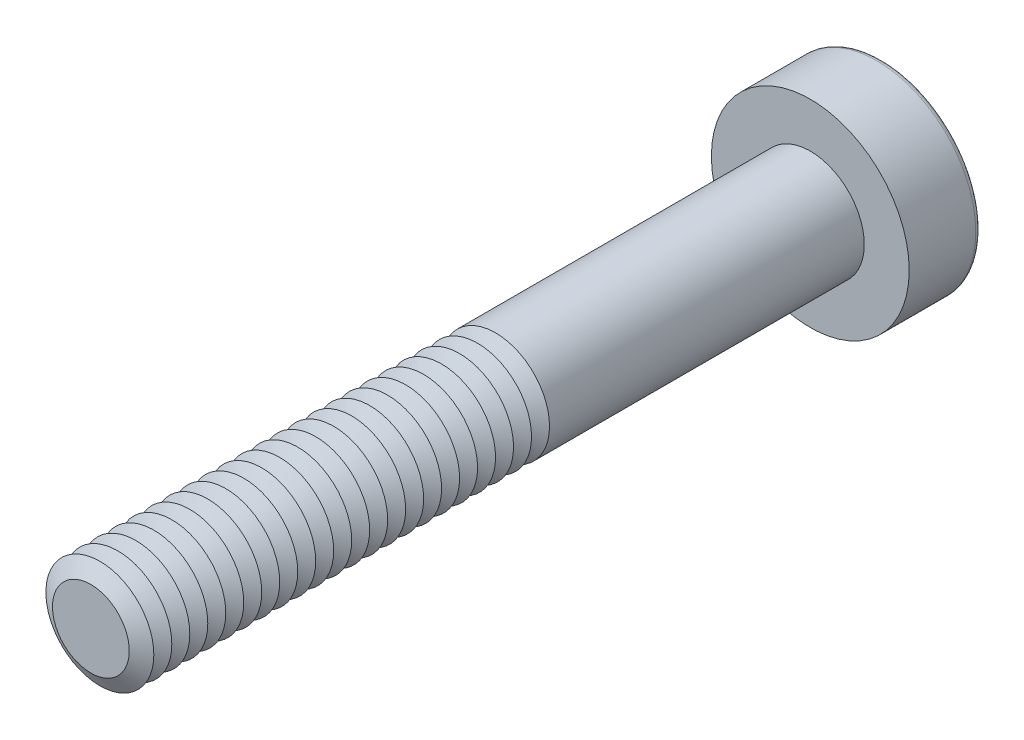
ISO-10303-21;
HEADER;
FILE_DESCRIPTION(('STEP AP214'),'2;1');
FILE_NAME('part.step','',(''),(''),'','','');
FILE_SCHEMA(('AUTOMOTIVE_DESIGN { 1 0 10303 214 1 1 1 1 }'));
ENDSEC;
DATA;
#1=APPLICATION_CONTEXT('core data for automotive mechanical design processes');
#2=APPLICATION_PROTOCOL_DEFINITION('international standard','automotive_design',2000,#1);
#3=PRODUCT_CONTEXT('',#1,'mechanical');
#4=PRODUCT('Part','Part','',(#3));
#5=PRODUCT_RELATED_PRODUCT_CATEGORY('part','',(#4));
#6=PRODUCT_DEFINITION_FORMATION('','',#4);
#7=PRODUCT_DEFINITION_CONTEXT('part definition',#1,'design');
#8=PRODUCT_DEFINITION('design','',#6,#7);
#9=PRODUCT_DEFINITION_SHAPE('','',#8);
#10=(LENGTH_UNIT() NAMED_UNIT(*) SI_UNIT(.MILLI.,.METRE.));
#11=(NAMED_UNIT(*) PLANE_ANGLE_UNIT() SI_UNIT($,.RADIAN.));
#12=(NAMED_UNIT(*) SI_UNIT($,.STERADIAN.) SOLID_ANGLE_UNIT());
#13=UNCERTAINTY_MEASURE_WITH_UNIT(LENGTH_MEASURE(1.E-05),#10,'distance_accuracy_value','');
#14=(GEOMETRIC_REPRESENTATION_CONTEXT(3) GLOBAL_UNCERTAINTY_ASSIGNED_CONTEXT((#13)) GLOBAL_UNIT_ASSIGNED_CONTEXT((#10,
#11,#12)) REPRESENTATION_CONTEXT('',''));
#15=CARTESIAN_POINT('',(0.,0.,0.));
#16=DIRECTION('',(0.,0.,1.));
#17=DIRECTION('',(1.,0.,0.));
#18=AXIS2_PLACEMENT_3D('',#15,#16,#17);
#19=CARTESIAN_POINT('',(0.,0.,18.25));
#20=DIRECTION('',(0.,0.,1.));
#21=DIRECTION('',(1.,0.,0.));
#22=AXIS2_PLACEMENT_3D('',#19,#20,#21);
#23=CONICAL_SURFACE('',#22,1.5,1.0471975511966);
#24=CARTESIAN_POINT('',(0.,0.,18.));
#25=DIRECTION('',(0.,0.,1.));
#26=DIRECTION('',(1.,0.,0.));
#27=AXIS2_PLACEMENT_3D('',#24,#25,#26);
#28=CIRCLE('',#27,1.06698729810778);
#29=CARTESIAN_POINT('',(1.06698729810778,0.,18.));
#30=VERTEX_POINT('',#29);
#31=EDGE_CURVE('E313',#30,#30,#28,.T.);
#32=ORIENTED_EDGE('',*,*,#31,.T.);
#33=EDGE_LOOP('',(#32));
#34=FACE_BOUND('',#33,.T.);
#35=CARTESIAN_POINT('',(0.,0.,18.25));
#36=DIRECTION('',(0.,0.,1.));
#37=DIRECTION('',(1.,0.,0.));
#38=AXIS2_PLACEMENT_3D('',#35,#36,#37);
#39=CIRCLE('',#38,1.5);
#40=CARTESIAN_POINT('',(1.5,0.,18.25));
#41=VERTEX_POINT('',#40);
#42=EDGE_CURVE('E316',#41,#41,#39,.T.);
#43=ORIENTED_EDGE('',*,*,#42,.F.);
#44=EDGE_LOOP('',(#43));
#45=FACE_BOUND('',#44,.T.);
#46=ADVANCED_FACE('F39',(#34,#45),#23,.T.);
#47=CARTESIAN_POINT('',(0.,0.,18.));
#48=DIRECTION('',(0.,0.,-1.));
#49=DIRECTION('',(-1.,0.,0.));
#50=AXIS2_PLACEMENT_3D('',#47,#48,#49);
#51=CONICAL_SURFACE('',#50,1.06698729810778,1.0471975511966);
#52=CARTESIAN_POINT('',(0.,0.,17.75));
#53=DIRECTION('',(0.,0.,1.));
#54=DIRECTION('',(1.,0.,0.));
#55=AXIS2_PLACEMENT_3D('',#52,#53,#54);
#56=CIRCLE('',#55,1.5);
#57=CARTESIAN_POINT('',(1.5,0.,17.75));
#58=VERTEX_POINT('',#57);
#59=EDGE_CURVE('E324',#58,#58,#56,.T.);
#60=ORIENTED_EDGE('',*,*,#59,.T.);
#61=EDGE_LOOP('',(#60));
#62=FACE_BOUND('',#61,.T.);
#63=ORIENTED_EDGE('',*,*,#31,.F.);
#64=EDGE_LOOP('',(#63));
#65=FACE_BOUND('',#64,.T.);
#66=ADVANCED_FACE('F244',(#62,#65),#51,.T.);
#67=CARTESIAN_POINT('',(0.,0.,20.));
#68=DIRECTION('',(0.,0.,1.));
#69=DIRECTION('',(1.,0.,0.));
#70=AXIS2_PLACEMENT_3D('',#67,#68,#69);
#71=PLANE('',#70);
#72=CARTESIAN_POINT('',(0.,0.,20.));
#73=DIRECTION('',(0.,0.,1.));
#74=DIRECTION('',(1.,0.,0.));
#75=AXIS2_PLACEMENT_3D('',#72,#73,#74);
#76=CIRCLE('',#75,1.06698729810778);
#77=CARTESIAN_POINT('',(1.06698729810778,0.,20.));
#78=VERTEX_POINT('',#77);
#79=EDGE_CURVE('E173',#78,#78,#76,.T.);
#80=ORIENTED_EDGE('',*,*,#79,.T.);
#81=EDGE_LOOP('',(#80));
#82=FACE_BOUND('',#81,.T.);
#83=ADVANCED_FACE('F250',(#82),#71,.T.);
#84=CARTESIAN_POINT('',(0.,0.,20.));
#85=DIRECTION('',(0.,0.,-1.));
#86=DIRECTION('',(-1.,0.,0.));
#87=AXIS2_PLACEMENT_3D('',#84,#85,#86);
#88=CONICAL_SURFACE('',#87,1.06698729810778,1.0471975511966);
#89=CARTESIAN_POINT('',(0.,0.,19.75));
#90=DIRECTION('',(0.,0.,1.));
#91=DIRECTION('',(1.,0.,0.));
#92=AXIS2_PLACEMENT_3D('',#89,#90,#91);
#93=CIRCLE('',#92,1.5);
#94=CARTESIAN_POINT('',(1.5,0.,19.75));
#95=VERTEX_POINT('',#94);
#96=EDGE_CURVE('E290',#95,#95,#93,.T.);
#97=ORIENTED_EDGE('',*,*,#96,.T.);
#98=EDGE_LOOP('',(#97));
#99=FACE_BOUND('',#98,.T.);
#100=ORIENTED_EDGE('',*,*,#79,.F.);
#101=EDGE_LOOP('',(#100));
#102=FACE_BOUND('',#101,.T.);
#103=ADVANCED_FACE('F198',(#99,#102),#88,.T.);
#104=CARTESIAN_POINT('',(0.,0.,19.75));
#105=DIRECTION('',(0.,0.,1.));
#106=DIRECTION('',(1.,0.,0.));
#107=AXIS2_PLACEMENT_3D('',#104,#105,#106);
#108=CONICAL_SURFACE('',#107,1.5,1.0471975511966);
#109=CARTESIAN_POINT('',(0.,0.,19.5));
#110=DIRECTION('',(0.,0.,1.));
#111=DIRECTION('',(1.,0.,0.));
#112=AXIS2_PLACEMENT_3D('',#109,#110,#111);
#113=CIRCLE('',#112,1.06698729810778);
#114=CARTESIAN_POINT('',(1.06698729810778,0.,19.5));
#115=VERTEX_POINT('',#114);
#116=EDGE_CURVE('E287',#115,#115,#113,.T.);
#117=ORIENTED_EDGE('',*,*,#116,.T.);
#118=EDGE_LOOP('',(#117));
#119=FACE_BOUND('',#118,.T.);
#120=ORIENTED_EDGE('',*,*,#96,.F.);
#121=EDGE_LOOP('',(#120));
#122=FACE_BOUND('',#121,.T.);
#123=ADVANCED_FACE('F276',(#119,#122),#108,.T.);
#124=CARTESIAN_POINT('',(0.,0.,19.5));
#125=DIRECTION('',(0.,0.,-1.));
#126=DIRECTION('',(-1.,0.,0.));
#127=AXIS2_PLACEMENT_3D('',#124,#125,#126);
#128=CONICAL_SURFACE('',#127,1.06698729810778,1.0471975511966);
#129=CARTESIAN_POINT('',(0.,0.,19.25));
#130=DIRECTION('',(0.,0.,1.));
#131=DIRECTION('',(1.,0.,0.));
#132=AXIS2_PLACEMENT_3D('',#129,#130,#131);
#133=CIRCLE('',#132,1.5);
#134=CARTESIAN_POINT('',(1.5,0.,19.25));
#135=VERTEX_POINT('',#134);
#136=EDGE_CURVE('E299',#135,#135,#133,.T.);
#137=ORIENTED_EDGE('',*,*,#136,.T.);
#138=EDGE_LOOP('',(#137));
#139=FACE_BOUND('',#138,.T.);
#140=ORIENTED_EDGE('',*,*,#116,.F.);
#141=EDGE_LOOP('',(#140));
#142=FACE_BOUND('',#141,.T.);
#143=ADVANCED_FACE('F273',(#139,#142),#128,.T.);
#144=CARTESIAN_POINT('',(0.,0.,19.25));
#145=DIRECTION('',(0.,0.,1.));
#146=DIRECTION('',(1.,0.,0.));
#147=AXIS2_PLACEMENT_3D('',#144,#145,#146);
#148=CONICAL_SURFACE('',#147,1.5,1.0471975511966);
#149=CARTESIAN_POINT('',(0.,0.,19.));
#150=DIRECTION('',(0.,0.,1.));
#151=DIRECTION('',(1.,0.,0.));
#152=AXIS2_PLACEMENT_3D('',#149,#150,#151);
#153=CIRCLE('',#152,1.06698729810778);
#154=CARTESIAN_POINT('',(1.06698729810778,0.,19.));
#155=VERTEX_POINT('',#154);
#156=EDGE_CURVE('E292',#155,#155,#153,.T.);
#157=ORIENTED_EDGE('',*,*,#156,.T.);
#158=EDGE_LOOP('',(#157));
#159=FACE_BOUND('',#158,.T.);
#160=ORIENTED_EDGE('',*,*,#136,.F.);
#161=EDGE_LOOP('',(#160));
#162=FACE_BOUND('',#161,.T.);
#163=ADVANCED_FACE('F269',(#159,#162),#148,.T.);
#164=CARTESIAN_POINT('',(0.,0.,19.));
#165=DIRECTION('',(0.,0.,-1.));
#166=DIRECTION('',(-1.,0.,0.));
#167=AXIS2_PLACEMENT_3D('',#164,#165,#166);
#168=CONICAL_SURFACE('',#167,1.06698729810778,1.0471975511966);
#169=CARTESIAN_POINT('',(0.,0.,18.75));
#170=DIRECTION('',(0.,0.,1.));
#171=DIRECTION('',(1.,0.,0.));
#172=AXIS2_PLACEMENT_3D('',#169,#170,#171);
#173=CIRCLE('',#172,1.5);
#174=CARTESIAN_POINT('',(1.5,0.,18.75));
#175=VERTEX_POINT('',#174);
#176=EDGE_CURVE('E309',#175,#175,#173,.T.);
#177=ORIENTED_EDGE('',*,*,#176,.T.);
#178=EDGE_LOOP('',(#177));
#179=FACE_BOUND('',#178,.T.);
#180=ORIENTED_EDGE('',*,*,#156,.F.);
#181=EDGE_LOOP('',(#180));
#182=FACE_BOUND('',#181,.T.);
#183=ADVANCED_FACE('F265',(#179,#182),#168,.T.);
#184=CARTESIAN_POINT('',(0.,0.,18.75));
#185=DIRECTION('',(0.,0.,1.));
#186=DIRECTION('',(1.,0.,0.));
#187=AXIS2_PLACEMENT_3D('',#184,#185,#186);
#188=CONICAL_SURFACE('',#187,1.5,1.0471975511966);
#189=CARTESIAN_POINT('',(0.,0.,18.5));
#190=DIRECTION('',(0.,0.,1.));
#191=DIRECTION('',(1.,0.,0.));
#192=AXIS2_PLACEMENT_3D('',#189,#190,#191);
#193=CIRCLE('',#192,1.06698729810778);
#194=CARTESIAN_POINT('',(1.06698729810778,0.,18.5));
#195=VERTEX_POINT('',#194);
#196=EDGE_CURVE('E305',#195,#195,#193,.T.);
#197=ORIENTED_EDGE('',*,*,#196,.T.);
#198=EDGE_LOOP('',(#197));
#199=FACE_BOUND('',#198,.T.);
#200=ORIENTED_EDGE('',*,*,#176,.F.);
#201=EDGE_LOOP('',(#200));
#202=FACE_BOUND('',#201,.T.);
#203=ADVANCED_FACE('F261',(#199,#202),#188,.T.);
#204=CARTESIAN_POINT('',(0.,0.,18.5));
#205=DIRECTION('',(0.,0.,-1.));
#206=DIRECTION('',(-1.,0.,0.));
#207=AXIS2_PLACEMENT_3D('',#204,#205,#206);
#208=CONICAL_SURFACE('',#207,1.06698729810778,1.0471975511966);
#209=ORIENTED_EDGE('',*,*,#42,.T.);
#210=EDGE_LOOP('',(#209));
#211=FACE_BOUND('',#210,.T.);
#212=ORIENTED_EDGE('',*,*,#196,.F.);
#213=EDGE_LOOP('',(#212));
#214=FACE_BOUND('',#213,.T.);
#215=ADVANCED_FACE('F257',(#211,#214),#208,.T.);
#216=CARTESIAN_POINT('',(0.,0.,17.75));
#217=DIRECTION('',(0.,0.,1.));
#218=DIRECTION('',(1.,0.,0.));
#219=AXIS2_PLACEMENT_3D('',#216,#217,#218);
#220=CONICAL_SURFACE('',#219,1.5,1.0471975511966);
#221=CARTESIAN_POINT('',(0.,0.,17.5));
#222=DIRECTION('',(0.,0.,1.));
#223=DIRECTION('',(1.,0.,0.));
#224=AXIS2_PLACEMENT_3D('',#221,#222,#223);
#225=CIRCLE('',#224,1.06698729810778);
#226=CARTESIAN_POINT('',(1.06698729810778,0.,17.5));
#227=VERTEX_POINT('',#226);
#228=EDGE_CURVE('E320',#227,#227,#225,.T.);
#229=ORIENTED_EDGE('',*,*,#228,.T.);
#230=EDGE_LOOP('',(#229));
#231=FACE_BOUND('',#230,.T.);
#232=ORIENTED_EDGE('',*,*,#59,.F.);
#233=EDGE_LOOP('',(#232));
#234=FACE_BOUND('',#233,.T.);
#235=ADVANCED_FACE('F260',(#231,#234),#220,.T.);
#236=CARTESIAN_POINT('',(0.,0.,17.5));
#237=DIRECTION('',(0.,0.,-1.));
#238=DIRECTION('',(-1.,0.,0.));
#239=AXIS2_PLACEMENT_3D('',#236,#237,#238);
#240=CONICAL_SURFACE('',#239,1.06698729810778,1.0471975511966);
#241=CARTESIAN_POINT('',(0.,0.,17.25));
#242=DIRECTION('',(0.,0.,1.));
#243=DIRECTION('',(1.,0.,0.));
#244=AXIS2_PLACEMENT_3D('',#241,#242,#243);
#245=CIRCLE('',#244,1.5);
#246=CARTESIAN_POINT('',(1.5,0.,17.25));
#247=VERTEX_POINT('',#246);
#248=EDGE_CURVE('E332',#247,#247,#245,.T.);
#249=ORIENTED_EDGE('',*,*,#248,.T.);
#250=EDGE_LOOP('',(#249));
#251=FACE_BOUND('',#250,.T.);
#252=ORIENTED_EDGE('',*,*,#228,.F.);
#253=EDGE_LOOP('',(#252));
#254=FACE_BOUND('',#253,.T.);
#255=ADVANCED_FACE('F607',(#251,#254),#240,.T.);
#256=CARTESIAN_POINT('',(0.,0.,17.25));
#257=DIRECTION('',(0.,0.,1.));
#258=DIRECTION('',(1.,0.,0.));
#259=AXIS2_PLACEMENT_3D('',#256,#257,#258);
#260=CONICAL_SURFACE('',#259,1.5,1.0471975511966);
#261=CARTESIAN_POINT('',(0.,0.,17.));
#262=DIRECTION('',(0.,0.,1.));
#263=DIRECTION('',(1.,0.,0.));
#264=AXIS2_PLACEMENT_3D('',#261,#262,#263);
#265=CIRCLE('',#264,1.06698729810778);
#266=CARTESIAN_POINT('',(1.06698729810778,0.,17.));
#267=VERTEX_POINT('',#266);
#268=EDGE_CURVE('E328',#267,#267,#265,.T.);
#269=ORIENTED_EDGE('',*,*,#268,.T.);
#270=EDGE_LOOP('',(#269));
#271=FACE_BOUND('',#270,.T.);
#272=ORIENTED_EDGE('',*,*,#248,.F.);
#273=EDGE_LOOP('',(#272));
#274=FACE_BOUND('',#273,.T.);
#275=ADVANCED_FACE('F603',(#271,#274),#260,.T.);
#276=CARTESIAN_POINT('',(0.,0.,17.));
#277=DIRECTION('',(0.,0.,-1.));
#278=DIRECTION('',(-1.,0.,0.));
#279=AXIS2_PLACEMENT_3D('',#276,#277,#278);
#280=CONICAL_SURFACE('',#279,1.06698729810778,1.0471975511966);
#281=CARTESIAN_POINT('',(0.,0.,16.75));
#282=DIRECTION('',(0.,0.,1.));
#283=DIRECTION('',(1.,0.,0.));
#284=AXIS2_PLACEMENT_3D('',#281,#282,#283);
#285=CIRCLE('',#284,1.5);
#286=CARTESIAN_POINT('',(1.5,0.,16.75));
#287=VERTEX_POINT('',#286);
#288=EDGE_CURVE('E340',#287,#287,#285,.T.);
#289=ORIENTED_EDGE('',*,*,#288,.T.);
#290=EDGE_LOOP('',(#289));
#291=FACE_BOUND('',#290,.T.);
#292=ORIENTED_EDGE('',*,*,#268,.F.);
#293=EDGE_LOOP('',(#292));
#294=FACE_BOUND('',#293,.T.);
#295=ADVANCED_FACE('F599',(#291,#294),#280,.T.);
#296=CARTESIAN_POINT('',(0.,0.,16.75));
#297=DIRECTION('',(0.,0.,1.));
#298=DIRECTION('',(1.,0.,0.));
#299=AXIS2_PLACEMENT_3D('',#296,#297,#298);
#300=CONICAL_SURFACE('',#299,1.5,1.0471975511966);
#301=CARTESIAN_POINT('',(0.,0.,16.5));
#302=DIRECTION('',(0.,0.,1.));
#303=DIRECTION('',(1.,0.,0.));
#304=AXIS2_PLACEMENT_3D('',#301,#302,#303);
#305=CIRCLE('',#304,1.06698729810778);
#306=CARTESIAN_POINT('',(1.06698729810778,0.,16.5));
#307=VERTEX_POINT('',#306);
#308=EDGE_CURVE('E336',#307,#307,#305,.T.);
#309=ORIENTED_EDGE('',*,*,#308,.T.);
#310=EDGE_LOOP('',(#309));
#311=FACE_BOUND('',#310,.T.);
#312=ORIENTED_EDGE('',*,*,#288,.F.);
#313=EDGE_LOOP('',(#312));
#314=FACE_BOUND('',#313,.T.);
#315=ADVANCED_FACE('F595',(#311,#314),#300,.T.);
#316=CARTESIAN_POINT('',(0.,0.,16.5));
#317=DIRECTION('',(0.,0.,-1.));
#318=DIRECTION('',(-1.,0.,0.));
#319=AXIS2_PLACEMENT_3D('',#316,#317,#318);
#320=CONICAL_SURFACE('',#319,1.06698729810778,1.0471975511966);
#321=CARTESIAN_POINT('',(0.,0.,16.25));
#322=DIRECTION('',(0.,0.,1.));
#323=DIRECTION('',(1.,0.,0.));
#324=AXIS2_PLACEMENT_3D('',#321,#322,#323);
#325=CIRCLE('',#324,1.5);
#326=CARTESIAN_POINT('',(1.5,0.,16.25));
#327=VERTEX_POINT('',#326);
#328=EDGE_CURVE('E348',#327,#327,#325,.T.);
#329=ORIENTED_EDGE('',*,*,#328,.T.);
#330=EDGE_LOOP('',(#329));
#331=FACE_BOUND('',#330,.T.);
#332=ORIENTED_EDGE('',*,*,#308,.F.);
#333=EDGE_LOOP('',(#332));
#334=FACE_BOUND('',#333,.T.);
#335=ADVANCED_FACE('F591',(#331,#334),#320,.T.);
#336=CARTESIAN_POINT('',(0.,0.,16.25));
#337=DIRECTION('',(0.,0.,1.));
#338=DIRECTION('',(1.,0.,0.));
#339=AXIS2_PLACEMENT_3D('',#336,#337,#338);
#340=CONICAL_SURFACE('',#339,1.5,1.0471975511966);
#341=CARTESIAN_POINT('',(0.,0.,16.));
#342=DIRECTION('',(0.,0.,1.));
#343=DIRECTION('',(1.,0.,0.));
#344=AXIS2_PLACEMENT_3D('',#341,#342,#343);
#345=CIRCLE('',#344,1.06698729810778);
#346=CARTESIAN_POINT('',(1.06698729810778,0.,16.));
#347=VERTEX_POINT('',#346);
#348=EDGE_CURVE('E344',#347,#347,#345,.T.);
#349=ORIENTED_EDGE('',*,*,#348,.T.);
#350=EDGE_LOOP('',(#349));
#351=FACE_BOUND('',#350,.T.);
#352=ORIENTED_EDGE('',*,*,#328,.F.);
#353=EDGE_LOOP('',(#352));
#354=FACE_BOUND('',#353,.T.);
#355=ADVANCED_FACE('F587',(#351,#354),#340,.T.);
#356=CARTESIAN_POINT('',(0.,0.,16.));
#357=DIRECTION('',(0.,0.,-1.));
#358=DIRECTION('',(-1.,0.,0.));
#359=AXIS2_PLACEMENT_3D('',#356,#357,#358);
#360=CONICAL_SURFACE('',#359,1.06698729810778,1.0471975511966);
#361=CARTESIAN_POINT('',(0.,0.,15.75));
#362=DIRECTION('',(0.,0.,1.));
#363=DIRECTION('',(1.,0.,0.));
#364=AXIS2_PLACEMENT_3D('',#361,#362,#363);
#365=CIRCLE('',#364,1.5);
#366=CARTESIAN_POINT('',(1.5,0.,15.75));
#367=VERTEX_POINT('',#366);
#368=EDGE_CURVE('E356',#367,#367,#365,.T.);
#369=ORIENTED_EDGE('',*,*,#368,.T.);
#370=EDGE_LOOP('',(#369));
#371=FACE_BOUND('',#370,.T.);
#372=ORIENTED_EDGE('',*,*,#348,.F.);
#373=EDGE_LOOP('',(#372));
#374=FACE_BOUND('',#373,.T.);
#375=ADVANCED_FACE('F583',(#371,#374),#360,.T.);
#376=CARTESIAN_POINT('',(0.,0.,15.75));
#377=DIRECTION('',(0.,0.,1.));
#378=DIRECTION('',(1.,0.,0.));
#379=AXIS2_PLACEMENT_3D('',#376,#377,#378);
#380=CONICAL_SURFACE('',#379,1.5,1.0471975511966);
#381=CARTESIAN_POINT('',(0.,0.,15.5));
#382=DIRECTION('',(0.,0.,1.));
#383=DIRECTION('',(1.,0.,0.));
#384=AXIS2_PLACEMENT_3D('',#381,#382,#383);
#385=CIRCLE('',#384,1.06698729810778);
#386=CARTESIAN_POINT('',(1.06698729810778,0.,15.5));
#387=VERTEX_POINT('',#386);
#388=EDGE_CURVE('E352',#387,#387,#385,.T.);
#389=ORIENTED_EDGE('',*,*,#388,.T.);
#390=EDGE_LOOP('',(#389));
#391=FACE_BOUND('',#390,.T.);
#392=ORIENTED_EDGE('',*,*,#368,.F.);
#393=EDGE_LOOP('',(#392));
#394=FACE_BOUND('',#393,.T.);
#395=ADVANCED_FACE('F579',(#391,#394),#380,.T.);
#396=CARTESIAN_POINT('',(0.,0.,15.5));
#397=DIRECTION('',(0.,0.,-1.));
#398=DIRECTION('',(-1.,0.,0.));
#399=AXIS2_PLACEMENT_3D('',#396,#397,#398);
#400=CONICAL_SURFACE('',#399,1.06698729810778,1.0471975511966);
#401=CARTESIAN_POINT('',(0.,0.,15.25));
#402=DIRECTION('',(0.,0.,1.));
#403=DIRECTION('',(1.,0.,0.));
#404=AXIS2_PLACEMENT_3D('',#401,#402,#403);
#405=CIRCLE('',#404,1.5);
#406=CARTESIAN_POINT('',(1.5,0.,15.25));
#407=VERTEX_POINT('',#406);
#408=EDGE_CURVE('E363',#407,#407,#405,.T.);
#409=ORIENTED_EDGE('',*,*,#408,.T.);
#410=EDGE_LOOP('',(#409));
#411=FACE_BOUND('',#410,.T.);
#412=ORIENTED_EDGE('',*,*,#388,.F.);
#413=EDGE_LOOP('',(#412));
#414=FACE_BOUND('',#413,.T.);
#415=ADVANCED_FACE('F575',(#411,#414),#400,.T.);
#416=CARTESIAN_POINT('',(0.,0.,15.25));
#417=DIRECTION('',(0.,0.,1.));
#418=DIRECTION('',(1.,0.,0.));
#419=AXIS2_PLACEMENT_3D('',#416,#417,#418);
#420=CONICAL_SURFACE('',#419,1.5,1.0471975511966);
#421=CARTESIAN_POINT('',(0.,0.,15.));
#422=DIRECTION('',(0.,0.,1.));
#423=DIRECTION('',(1.,0.,0.));
#424=AXIS2_PLACEMENT_3D('',#421,#422,#423);
#425=CIRCLE('',#424,1.06698729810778);
#426=CARTESIAN_POINT('',(1.06698729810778,0.,15.));
#427=VERTEX_POINT('',#426);
#428=EDGE_CURVE('E359',#427,#427,#425,.T.);
#429=ORIENTED_EDGE('',*,*,#428,.T.);
#430=EDGE_LOOP('',(#429));
#431=FACE_BOUND('',#430,.T.);
#432=ORIENTED_EDGE('',*,*,#408,.F.);
#433=EDGE_LOOP('',(#432));
#434=FACE_BOUND('',#433,.T.);
#435=ADVANCED_FACE('F571',(#431,#434),#420,.T.);
#436=CARTESIAN_POINT('',(0.,0.,15.));
#437=DIRECTION('',(0.,0.,-1.));
#438=DIRECTION('',(-1.,0.,0.));
#439=AXIS2_PLACEMENT_3D('',#436,#437,#438);
#440=CONICAL_SURFACE('',#439,1.06698729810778,1.0471975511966);
#441=CARTESIAN_POINT('',(0.,0.,14.75));
#442=DIRECTION('',(0.,0.,1.));
#443=DIRECTION('',(1.,0.,0.));
#444=AXIS2_PLACEMENT_3D('',#441,#442,#443);
#445=CIRCLE('',#444,1.5);
#446=CARTESIAN_POINT('',(1.5,0.,14.75));
#447=VERTEX_POINT('',#446);
#448=EDGE_CURVE('E371',#447,#447,#445,.T.);
#449=ORIENTED_EDGE('',*,*,#448,.T.);
#450=EDGE_LOOP('',(#449));
#451=FACE_BOUND('',#450,.T.);
#452=ORIENTED_EDGE('',*,*,#428,.F.);
#453=EDGE_LOOP('',(#452));
#454=FACE_BOUND('',#453,.T.);
#455=ADVANCED_FACE('F567',(#451,#454),#440,.T.);
#456=CARTESIAN_POINT('',(0.,0.,14.75));
#457=DIRECTION('',(0.,0.,1.));
#458=DIRECTION('',(1.,0.,0.));
#459=AXIS2_PLACEMENT_3D('',#456,#457,#458);
#460=CONICAL_SURFACE('',#459,1.5,1.0471975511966);
#461=CARTESIAN_POINT('',(0.,0.,14.5));
#462=DIRECTION('',(0.,0.,1.));
#463=DIRECTION('',(1.,0.,0.));
#464=AXIS2_PLACEMENT_3D('',#461,#462,#463);
#465=CIRCLE('',#464,1.06698729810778);
#466=CARTESIAN_POINT('',(1.06698729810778,0.,14.5));
#467=VERTEX_POINT('',#466);
#468=EDGE_CURVE('E367',#467,#467,#465,.T.);
#469=ORIENTED_EDGE('',*,*,#468,.T.);
#470=EDGE_LOOP('',(#469));
#471=FACE_BOUND('',#470,.T.);
#472=ORIENTED_EDGE('',*,*,#448,.F.);
#473=EDGE_LOOP('',(#472));
#474=FACE_BOUND('',#473,.T.);
#475=ADVANCED_FACE('F563',(#471,#474),#460,.T.);
#476=CARTESIAN_POINT('',(0.,0.,14.5));
#477=DIRECTION('',(0.,0.,-1.));
#478=DIRECTION('',(-1.,0.,0.));
#479=AXIS2_PLACEMENT_3D('',#476,#477,#478);
#480=CONICAL_SURFACE('',#479,1.06698729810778,1.0471975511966);
#481=CARTESIAN_POINT('',(0.,0.,14.25));
#482=DIRECTION('',(0.,0.,1.));
#483=DIRECTION('',(1.,0.,0.));
#484=AXIS2_PLACEMENT_3D('',#481,#482,#483);
#485=CIRCLE('',#484,1.5);
#486=CARTESIAN_POINT('',(1.5,0.,14.25));
#487=VERTEX_POINT('',#486);
#488=EDGE_CURVE('E378',#487,#487,#485,.T.);
#489=ORIENTED_EDGE('',*,*,#488,.T.);
#490=EDGE_LOOP('',(#489));
#491=FACE_BOUND('',#490,.T.);
#492=ORIENTED_EDGE('',*,*,#468,.F.);
#493=EDGE_LOOP('',(#492));
#494=FACE_BOUND('',#493,.T.);
#495=ADVANCED_FACE('F559',(#491,#494),#480,.T.);
#496=CARTESIAN_POINT('',(0.,0.,14.25));
#497=DIRECTION('',(0.,0.,1.));
#498=DIRECTION('',(1.,0.,0.));
#499=AXIS2_PLACEMENT_3D('',#496,#497,#498);
#500=CONICAL_SURFACE('',#499,1.5,1.0471975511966);
#501=CARTESIAN_POINT('',(0.,0.,14.));
#502=DIRECTION('',(0.,0.,1.));
#503=DIRECTION('',(1.,0.,0.));
#504=AXIS2_PLACEMENT_3D('',#501,#502,#503);
#505=CIRCLE('',#504,1.06698729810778);
#506=CARTESIAN_POINT('',(1.06698729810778,0.,14.));
#507=VERTEX_POINT('',#506);
#508=EDGE_CURVE('E375',#507,#507,#505,.T.);
#509=ORIENTED_EDGE('',*,*,#508,.T.);
#510=EDGE_LOOP('',(#509));
#511=FACE_BOUND('',#510,.T.);
#512=ORIENTED_EDGE('',*,*,#488,.F.);
#513=EDGE_LOOP('',(#512));
#514=FACE_BOUND('',#513,.T.);
#515=ADVANCED_FACE('F555',(#511,#514),#500,.T.);
#516=CARTESIAN_POINT('',(0.,0.,14.));
#517=DIRECTION('',(0.,0.,-1.));
#518=DIRECTION('',(-1.,0.,0.));
#519=AXIS2_PLACEMENT_3D('',#516,#517,#518);
#520=CONICAL_SURFACE('',#519,1.06698729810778,1.0471975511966);
#521=CARTESIAN_POINT('',(0.,0.,13.75));
#522=DIRECTION('',(0.,0.,1.));
#523=DIRECTION('',(1.,0.,0.));
#524=AXIS2_PLACEMENT_3D('',#521,#522,#523);
#525=CIRCLE('',#524,1.5);
#526=CARTESIAN_POINT('',(1.5,0.,13.75));
#527=VERTEX_POINT('',#526);
#528=EDGE_CURVE('E386',#527,#527,#525,.T.);
#529=ORIENTED_EDGE('',*,*,#528,.T.);
#530=EDGE_LOOP('',(#529));
#531=FACE_BOUND('',#530,.T.);
#532=ORIENTED_EDGE('',*,*,#508,.F.);
#533=EDGE_LOOP('',(#532));
#534=FACE_BOUND('',#533,.T.);
#535=ADVANCED_FACE('F551',(#531,#534),#520,.T.);
#536=CARTESIAN_POINT('',(0.,0.,13.75));
#537=DIRECTION('',(0.,0.,1.));
#538=DIRECTION('',(1.,0.,0.));
#539=AXIS2_PLACEMENT_3D('',#536,#537,#538);
#540=CONICAL_SURFACE('',#539,1.5,1.0471975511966);
#541=CARTESIAN_POINT('',(0.,0.,13.5));
#542=DIRECTION('',(0.,0.,1.));
#543=DIRECTION('',(1.,0.,0.));
#544=AXIS2_PLACEMENT_3D('',#541,#542,#543);
#545=CIRCLE('',#544,1.06698729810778);
#546=CARTESIAN_POINT('',(1.06698729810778,0.,13.5));
#547=VERTEX_POINT('',#546);
#548=EDGE_CURVE('E382',#547,#547,#545,.T.);
#549=ORIENTED_EDGE('',*,*,#548,.T.);
#550=EDGE_LOOP('',(#549));
#551=FACE_BOUND('',#550,.T.);
#552=ORIENTED_EDGE('',*,*,#528,.F.);
#553=EDGE_LOOP('',(#552));
#554=FACE_BOUND('',#553,.T.);
#555=ADVANCED_FACE('F547',(#551,#554),#540,.T.);
#556=CARTESIAN_POINT('',(0.,0.,13.5));
#557=DIRECTION('',(0.,0.,-1.));
#558=DIRECTION('',(-1.,0.,0.));
#559=AXIS2_PLACEMENT_3D('',#556,#557,#558);
#560=CONICAL_SURFACE('',#559,1.06698729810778,1.0471975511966);
#561=CARTESIAN_POINT('',(0.,0.,13.25));
#562=DIRECTION('',(0.,0.,1.));
#563=DIRECTION('',(1.,0.,0.));
#564=AXIS2_PLACEMENT_3D('',#561,#562,#563);
#565=CIRCLE('',#564,1.5);
#566=CARTESIAN_POINT('',(1.5,0.,13.25));
#567=VERTEX_POINT('',#566);
#568=EDGE_CURVE('E394',#567,#567,#565,.T.);
#569=ORIENTED_EDGE('',*,*,#568,.T.);
#570=EDGE_LOOP('',(#569));
#571=FACE_BOUND('',#570,.T.);
#572=ORIENTED_EDGE('',*,*,#548,.F.);
#573=EDGE_LOOP('',(#572));
#574=FACE_BOUND('',#573,.T.);
#575=ADVANCED_FACE('F543',(#571,#574),#560,.T.);
#576=CARTESIAN_POINT('',(0.,0.,13.25));
#577=DIRECTION('',(0.,0.,1.));
#578=DIRECTION('',(1.,0.,0.));
#579=AXIS2_PLACEMENT_3D('',#576,#577,#578);
#580=CONICAL_SURFACE('',#579,1.5,1.0471975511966);
#581=CARTESIAN_POINT('',(0.,0.,13.));
#582=DIRECTION('',(0.,0.,1.));
#583=DIRECTION('',(1.,0.,0.));
#584=AXIS2_PLACEMENT_3D('',#581,#582,#583);
#585=CIRCLE('',#584,1.06698729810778);
#586=CARTESIAN_POINT('',(1.06698729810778,0.,13.));
#587=VERTEX_POINT('',#586);
#588=EDGE_CURVE('E390',#587,#587,#585,.T.);
#589=ORIENTED_EDGE('',*,*,#588,.T.);
#590=EDGE_LOOP('',(#589));
#591=FACE_BOUND('',#590,.T.);
#592=ORIENTED_EDGE('',*,*,#568,.F.);
#593=EDGE_LOOP('',(#592));
#594=FACE_BOUND('',#593,.T.);
#595=ADVANCED_FACE('F539',(#591,#594),#580,.T.);
#596=CARTESIAN_POINT('',(0.,0.,13.));
#597=DIRECTION('',(0.,0.,-1.));
#598=DIRECTION('',(-1.,0.,0.));
#599=AXIS2_PLACEMENT_3D('',#596,#597,#598);
#600=CONICAL_SURFACE('',#599,1.06698729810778,1.0471975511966);
#601=CARTESIAN_POINT('',(0.,0.,12.75));
#602=DIRECTION('',(0.,0.,1.));
#603=DIRECTION('',(1.,0.,0.));
#604=AXIS2_PLACEMENT_3D('',#601,#602,#603);
#605=CIRCLE('',#604,1.5);
#606=CARTESIAN_POINT('',(1.5,0.,12.75));
#607=VERTEX_POINT('',#606);
#608=EDGE_CURVE('E402',#607,#607,#605,.T.);
#609=ORIENTED_EDGE('',*,*,#608,.T.);
#610=EDGE_LOOP('',(#609));
#611=FACE_BOUND('',#610,.T.);
#612=ORIENTED_EDGE('',*,*,#588,.F.);
#613=EDGE_LOOP('',(#612));
#614=FACE_BOUND('',#613,.T.);
#615=ADVANCED_FACE('F535',(#611,#614),#600,.T.);
#616=CARTESIAN_POINT('',(0.,0.,12.75));
#617=DIRECTION('',(0.,0.,1.));
#618=DIRECTION('',(1.,0.,0.));
#619=AXIS2_PLACEMENT_3D('',#616,#617,#618);
#620=CONICAL_SURFACE('',#619,1.5,1.0471975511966);
#621=CARTESIAN_POINT('',(0.,0.,12.5));
#622=DIRECTION('',(0.,0.,1.));
#623=DIRECTION('',(1.,0.,0.));
#624=AXIS2_PLACEMENT_3D('',#621,#622,#623);
#625=CIRCLE('',#624,1.06698729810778);
#626=CARTESIAN_POINT('',(1.06698729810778,0.,12.5));
#627=VERTEX_POINT('',#626);
#628=EDGE_CURVE('E398',#627,#627,#625,.T.);
#629=ORIENTED_EDGE('',*,*,#628,.T.);
#630=EDGE_LOOP('',(#629));
#631=FACE_BOUND('',#630,.T.);
#632=ORIENTED_EDGE('',*,*,#608,.F.);
#633=EDGE_LOOP('',(#632));
#634=FACE_BOUND('',#633,.T.);
#635=ADVANCED_FACE('F531',(#631,#634),#620,.T.);
#636=CARTESIAN_POINT('',(0.,0.,12.5));
#637=DIRECTION('',(0.,0.,-1.));
#638=DIRECTION('',(-1.,0.,0.));
#639=AXIS2_PLACEMENT_3D('',#636,#637,#638);
#640=CONICAL_SURFACE('',#639,1.06698729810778,1.0471975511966);
#641=CARTESIAN_POINT('',(0.,0.,12.25));
#642=DIRECTION('',(0.,0.,1.));
#643=DIRECTION('',(1.,0.,0.));
#644=AXIS2_PLACEMENT_3D('',#641,#642,#643);
#645=CIRCLE('',#644,1.5);
#646=CARTESIAN_POINT('',(1.5,0.,12.25));
#647=VERTEX_POINT('',#646);
#648=EDGE_CURVE('E410',#647,#647,#645,.T.);
#649=ORIENTED_EDGE('',*,*,#648,.T.);
#650=EDGE_LOOP('',(#649));
#651=FACE_BOUND('',#650,.T.);
#652=ORIENTED_EDGE('',*,*,#628,.F.);
#653=EDGE_LOOP('',(#652));
#654=FACE_BOUND('',#653,.T.);
#655=ADVANCED_FACE('F527',(#651,#654),#640,.T.);
#656=CARTESIAN_POINT('',(0.,0.,12.25));
#657=DIRECTION('',(0.,0.,1.));
#658=DIRECTION('',(1.,0.,0.));
#659=AXIS2_PLACEMENT_3D('',#656,#657,#658);
#660=CONICAL_SURFACE('',#659,1.5,1.0471975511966);
#661=CARTESIAN_POINT('',(0.,0.,12.));
#662=DIRECTION('',(0.,0.,1.));
#663=DIRECTION('',(1.,0.,0.));
#664=AXIS2_PLACEMENT_3D('',#661,#662,#663);
#665=CIRCLE('',#664,1.06698729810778);
#666=CARTESIAN_POINT('',(1.06698729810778,0.,12.));
#667=VERTEX_POINT('',#666);
#668=EDGE_CURVE('E406',#667,#667,#665,.T.);
#669=ORIENTED_EDGE('',*,*,#668,.T.);
#670=EDGE_LOOP('',(#669));
#671=FACE_BOUND('',#670,.T.);
#672=ORIENTED_EDGE('',*,*,#648,.F.);
#673=EDGE_LOOP('',(#672));
#674=FACE_BOUND('',#673,.T.);
#675=ADVANCED_FACE('F523',(#671,#674),#660,.T.);
#676=CARTESIAN_POINT('',(0.,0.,12.));
#677=DIRECTION('',(0.,0.,-1.));
#678=DIRECTION('',(-1.,0.,0.));
#679=AXIS2_PLACEMENT_3D('',#676,#677,#678);
#680=CONICAL_SURFACE('',#679,1.06698729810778,1.0471975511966);
#681=CARTESIAN_POINT('',(0.,0.,11.75));
#682=DIRECTION('',(0.,0.,1.));
#683=DIRECTION('',(1.,0.,0.));
#684=AXIS2_PLACEMENT_3D('',#681,#682,#683);
#685=CIRCLE('',#684,1.5);
#686=CARTESIAN_POINT('',(1.5,0.,11.75));
#687=VERTEX_POINT('',#686);
#688=EDGE_CURVE('E418',#687,#687,#685,.T.);
#689=ORIENTED_EDGE('',*,*,#688,.T.);
#690=EDGE_LOOP('',(#689));
#691=FACE_BOUND('',#690,.T.);
#692=ORIENTED_EDGE('',*,*,#668,.F.);
#693=EDGE_LOOP('',(#692));
#694=FACE_BOUND('',#693,.T.);
#695=ADVANCED_FACE('F519',(#691,#694),#680,.T.);
#696=CARTESIAN_POINT('',(0.,0.,11.75));
#697=DIRECTION('',(0.,0.,1.));
#698=DIRECTION('',(1.,0.,0.));
#699=AXIS2_PLACEMENT_3D('',#696,#697,#698);
#700=CONICAL_SURFACE('',#699,1.5,1.0471975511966);
#701=CARTESIAN_POINT('',(0.,0.,11.5));
#702=DIRECTION('',(0.,0.,1.));
#703=DIRECTION('',(1.,0.,0.));
#704=AXIS2_PLACEMENT_3D('',#701,#702,#703);
#705=CIRCLE('',#704,1.06698729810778);
#706=CARTESIAN_POINT('',(1.06698729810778,0.,11.5));
#707=VERTEX_POINT('',#706);
#708=EDGE_CURVE('E414',#707,#707,#705,.T.);
#709=ORIENTED_EDGE('',*,*,#708,.T.);
#710=EDGE_LOOP('',(#709));
#711=FACE_BOUND('',#710,.T.);
#712=ORIENTED_EDGE('',*,*,#688,.F.);
#713=EDGE_LOOP('',(#712));
#714=FACE_BOUND('',#713,.T.);
#715=ADVANCED_FACE('F515',(#711,#714),#700,.T.);
#716=CARTESIAN_POINT('',(0.,0.,11.5));
#717=DIRECTION('',(0.,0.,-1.));
#718=DIRECTION('',(-1.,0.,0.));
#719=AXIS2_PLACEMENT_3D('',#716,#717,#718);
#720=CONICAL_SURFACE('',#719,1.06698729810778,1.0471975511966);
#721=CARTESIAN_POINT('',(0.,0.,11.25));
#722=DIRECTION('',(0.,0.,1.));
#723=DIRECTION('',(1.,0.,0.));
#724=AXIS2_PLACEMENT_3D('',#721,#722,#723);
#725=CIRCLE('',#724,1.5);
#726=CARTESIAN_POINT('',(1.5,0.,11.25));
#727=VERTEX_POINT('',#726);
#728=EDGE_CURVE('E426',#727,#727,#725,.T.);
#729=ORIENTED_EDGE('',*,*,#728,.T.);
#730=EDGE_LOOP('',(#729));
#731=FACE_BOUND('',#730,.T.);
#732=ORIENTED_EDGE('',*,*,#708,.F.);
#733=EDGE_LOOP('',(#732));
#734=FACE_BOUND('',#733,.T.);
#735=ADVANCED_FACE('F511',(#731,#734),#720,.T.);
#736=CARTESIAN_POINT('',(0.,0.,11.25));
#737=DIRECTION('',(0.,0.,1.));
#738=DIRECTION('',(1.,0.,0.));
#739=AXIS2_PLACEMENT_3D('',#736,#737,#738);
#740=CONICAL_SURFACE('',#739,1.5,1.0471975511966);
#741=CARTESIAN_POINT('',(0.,0.,11.));
#742=DIRECTION('',(0.,0.,1.));
#743=DIRECTION('',(1.,0.,0.));
#744=AXIS2_PLACEMENT_3D('',#741,#742,#743);
#745=CIRCLE('',#744,1.06698729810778);
#746=CARTESIAN_POINT('',(1.06698729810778,0.,11.));
#747=VERTEX_POINT('',#746);
#748=EDGE_CURVE('E422',#747,#747,#745,.T.);
#749=ORIENTED_EDGE('',*,*,#748,.T.);
#750=EDGE_LOOP('',(#749));
#751=FACE_BOUND('',#750,.T.);
#752=ORIENTED_EDGE('',*,*,#728,.F.);
#753=EDGE_LOOP('',(#752));
#754=FACE_BOUND('',#753,.T.);
#755=ADVANCED_FACE('F507',(#751,#754),#740,.T.);
#756=CARTESIAN_POINT('',(0.,0.,11.));
#757=DIRECTION('',(0.,0.,-1.));
#758=DIRECTION('',(-1.,0.,0.));
#759=AXIS2_PLACEMENT_3D('',#756,#757,#758);
#760=CONICAL_SURFACE('',#759,1.06698729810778,1.0471975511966);
#761=CARTESIAN_POINT('',(0.,0.,10.75));
#762=DIRECTION('',(0.,0.,1.));
#763=DIRECTION('',(1.,0.,0.));
#764=AXIS2_PLACEMENT_3D('',#761,#762,#763);
#765=CIRCLE('',#764,1.5);
#766=CARTESIAN_POINT('',(1.5,0.,10.75));
#767=VERTEX_POINT('',#766);
#768=EDGE_CURVE('E434',#767,#767,#765,.T.);
#769=ORIENTED_EDGE('',*,*,#768,.T.);
#770=EDGE_LOOP('',(#769));
#771=FACE_BOUND('',#770,.T.);
#772=ORIENTED_EDGE('',*,*,#748,.F.);
#773=EDGE_LOOP('',(#772));
#774=FACE_BOUND('',#773,.T.);
#775=ADVANCED_FACE('F503',(#771,#774),#760,.T.);
#776=CARTESIAN_POINT('',(0.,0.,10.75));
#777=DIRECTION('',(0.,0.,1.));
#778=DIRECTION('',(1.,0.,0.));
#779=AXIS2_PLACEMENT_3D('',#776,#777,#778);
#780=CONICAL_SURFACE('',#779,1.5,1.0471975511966);
#781=CARTESIAN_POINT('',(0.,0.,10.5));
#782=DIRECTION('',(0.,0.,1.));
#783=DIRECTION('',(1.,0.,0.));
#784=AXIS2_PLACEMENT_3D('',#781,#782,#783);
#785=CIRCLE('',#784,1.06698729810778);
#786=CARTESIAN_POINT('',(1.06698729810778,0.,10.5));
#787=VERTEX_POINT('',#786);
#788=EDGE_CURVE('E430',#787,#787,#785,.T.);
#789=ORIENTED_EDGE('',*,*,#788,.T.);
#790=EDGE_LOOP('',(#789));
#791=FACE_BOUND('',#790,.T.);
#792=ORIENTED_EDGE('',*,*,#768,.F.);
#793=EDGE_LOOP('',(#792));
#794=FACE_BOUND('',#793,.T.);
#795=ADVANCED_FACE('F499',(#791,#794),#780,.T.);
#796=CARTESIAN_POINT('',(0.,0.,10.5));
#797=DIRECTION('',(0.,0.,-1.));
#798=DIRECTION('',(-1.,0.,0.));
#799=AXIS2_PLACEMENT_3D('',#796,#797,#798);
#800=CONICAL_SURFACE('',#799,1.06698729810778,1.0471975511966);
#801=CARTESIAN_POINT('',(0.,0.,10.25));
#802=DIRECTION('',(0.,0.,1.));
#803=DIRECTION('',(1.,0.,0.));
#804=AXIS2_PLACEMENT_3D('',#801,#802,#803);
#805=CIRCLE('',#804,1.5);
#806=CARTESIAN_POINT('',(1.5,0.,10.25));
#807=VERTEX_POINT('',#806);
#808=EDGE_CURVE('E442',#807,#807,#805,.T.);
#809=ORIENTED_EDGE('',*,*,#808,.T.);
#810=EDGE_LOOP('',(#809));
#811=FACE_BOUND('',#810,.T.);
#812=ORIENTED_EDGE('',*,*,#788,.F.);
#813=EDGE_LOOP('',(#812));
#814=FACE_BOUND('',#813,.T.);
#815=ADVANCED_FACE('F495',(#811,#814),#800,.T.);
#816=CARTESIAN_POINT('',(0.,0.,10.25));
#817=DIRECTION('',(0.,0.,1.));
#818=DIRECTION('',(1.,0.,0.));
#819=AXIS2_PLACEMENT_3D('',#816,#817,#818);
#820=CONICAL_SURFACE('',#819,1.5,1.0471975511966);
#821=CARTESIAN_POINT('',(0.,0.,10.));
#822=DIRECTION('',(0.,0.,1.));
#823=DIRECTION('',(1.,0.,0.));
#824=AXIS2_PLACEMENT_3D('',#821,#822,#823);
#825=CIRCLE('',#824,1.06698729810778);
#826=CARTESIAN_POINT('',(1.06698729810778,0.,10.));
#827=VERTEX_POINT('',#826);
#828=EDGE_CURVE('E438',#827,#827,#825,.T.);
#829=ORIENTED_EDGE('',*,*,#828,.T.);
#830=EDGE_LOOP('',(#829));
#831=FACE_BOUND('',#830,.T.);
#832=ORIENTED_EDGE('',*,*,#808,.F.);
#833=EDGE_LOOP('',(#832));
#834=FACE_BOUND('',#833,.T.);
#835=ADVANCED_FACE('F491',(#831,#834),#820,.T.);
#836=CARTESIAN_POINT('',(0.,0.,10.));
#837=DIRECTION('',(0.,0.,-1.));
#838=DIRECTION('',(-1.,0.,0.));
#839=AXIS2_PLACEMENT_3D('',#836,#837,#838);
#840=CONICAL_SURFACE('',#839,1.06698729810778,1.0471975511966);
#841=CARTESIAN_POINT('',(0.,0.,9.75));
#842=DIRECTION('',(0.,0.,1.));
#843=DIRECTION('',(1.,0.,0.));
#844=AXIS2_PLACEMENT_3D('',#841,#842,#843);
#845=CIRCLE('',#844,1.5);
#846=CARTESIAN_POINT('',(1.5,0.,9.75));
#847=VERTEX_POINT('',#846);
#848=EDGE_CURVE('E450',#847,#847,#845,.T.);
#849=ORIENTED_EDGE('',*,*,#848,.T.);
#850=EDGE_LOOP('',(#849));
#851=FACE_BOUND('',#850,.T.);
#852=ORIENTED_EDGE('',*,*,#828,.F.);
#853=EDGE_LOOP('',(#852));
#854=FACE_BOUND('',#853,.T.);
#855=ADVANCED_FACE('F487',(#851,#854),#840,.T.);
#856=CARTESIAN_POINT('',(0.,0.,9.75));
#857=DIRECTION('',(0.,0.,1.));
#858=DIRECTION('',(1.,0.,0.));
#859=AXIS2_PLACEMENT_3D('',#856,#857,#858);
#860=CONICAL_SURFACE('',#859,1.5,1.0471975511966);
#861=CARTESIAN_POINT('',(0.,0.,9.5));
#862=DIRECTION('',(0.,0.,1.));
#863=DIRECTION('',(1.,0.,0.));
#864=AXIS2_PLACEMENT_3D('',#861,#862,#863);
#865=CIRCLE('',#864,1.06698729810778);
#866=CARTESIAN_POINT('',(1.06698729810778,0.,9.5));
#867=VERTEX_POINT('',#866);
#868=EDGE_CURVE('E446',#867,#867,#865,.T.);
#869=ORIENTED_EDGE('',*,*,#868,.T.);
#870=EDGE_LOOP('',(#869));
#871=FACE_BOUND('',#870,.T.);
#872=ORIENTED_EDGE('',*,*,#848,.F.);
#873=EDGE_LOOP('',(#872));
#874=FACE_BOUND('',#873,.T.);
#875=ADVANCED_FACE('F482',(#871,#874),#860,.T.);
#876=CARTESIAN_POINT('',(0.,0.,9.5));
#877=DIRECTION('',(0.,0.,-1.));
#878=DIRECTION('',(-1.,0.,0.));
#879=AXIS2_PLACEMENT_3D('',#876,#877,#878);
#880=CONICAL_SURFACE('',#879,1.06698729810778,1.0471975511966);
#881=CARTESIAN_POINT('',(0.,0.,9.25));
#882=DIRECTION('',(0.,0.,1.));
#883=DIRECTION('',(1.,0.,0.));
#884=AXIS2_PLACEMENT_3D('',#881,#882,#883);
#885=CIRCLE('',#884,1.5);
#886=CARTESIAN_POINT('',(1.5,0.,9.25));
#887=VERTEX_POINT('',#886);
#888=EDGE_CURVE('E462',#887,#887,#885,.T.);
#889=ORIENTED_EDGE('',*,*,#888,.T.);
#890=EDGE_LOOP('',(#889));
#891=FACE_BOUND('',#890,.T.);
#892=ORIENTED_EDGE('',*,*,#868,.F.);
#893=EDGE_LOOP('',(#892));
#894=FACE_BOUND('',#893,.T.);
#895=ADVANCED_FACE('F468',(#891,#894),#880,.T.);
#896=CARTESIAN_POINT('',(0.,0.,9.25));
#897=DIRECTION('',(0.,0.,1.));
#898=DIRECTION('',(1.,0.,0.));
#899=AXIS2_PLACEMENT_3D('',#896,#897,#898);
#900=CONICAL_SURFACE('',#899,1.5,1.0471975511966);
#901=CARTESIAN_POINT('',(0.,0.,9.));
#902=DIRECTION('',(0.,0.,1.));
#903=DIRECTION('',(1.,0.,0.));
#904=AXIS2_PLACEMENT_3D('',#901,#902,#903);
#905=CIRCLE('',#904,1.06698729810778);
#906=CARTESIAN_POINT('',(1.06698729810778,0.,9.));
#907=VERTEX_POINT('',#906);
#908=EDGE_CURVE('E454',#907,#907,#905,.T.);
#909=ORIENTED_EDGE('',*,*,#908,.T.);
#910=EDGE_LOOP('',(#909));
#911=FACE_BOUND('',#910,.T.);
#912=ORIENTED_EDGE('',*,*,#888,.F.);
#913=EDGE_LOOP('',(#912));
#914=FACE_BOUND('',#913,.T.);
#915=ADVANCED_FACE('F471',(#911,#914),#900,.T.);
#916=CARTESIAN_POINT('',(0.,0.,9.));
#917=DIRECTION('',(0.,0.,-1.));
#918=DIRECTION('',(-1.,0.,0.));
#919=AXIS2_PLACEMENT_3D('',#916,#917,#918);
#920=CONICAL_SURFACE('',#919,1.06698729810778,1.0471975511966);
#921=CARTESIAN_POINT('',(0.,0.,8.75));
#922=DIRECTION('',(0.,0.,1.));
#923=DIRECTION('',(1.,0.,0.));
#924=AXIS2_PLACEMENT_3D('',#921,#922,#923);
#925=CIRCLE('',#924,1.5);
#926=CARTESIAN_POINT('',(1.5,0.,8.75));
#927=VERTEX_POINT('',#926);
#928=EDGE_CURVE('E458',#927,#927,#925,.T.);
#929=ORIENTED_EDGE('',*,*,#928,.T.);
#930=EDGE_LOOP('',(#929));
#931=FACE_BOUND('',#930,.T.);
#932=ORIENTED_EDGE('',*,*,#908,.F.);
#933=EDGE_LOOP('',(#932));
#934=FACE_BOUND('',#933,.T.);
#935=ADVANCED_FACE('F473',(#931,#934),#920,.T.);
#936=CARTESIAN_POINT('',(0.,0.,-0.5));
#937=DIRECTION('',(0.,0.,-1.));
#938=DIRECTION('',(-1.,0.,0.));
#939=AXIS2_PLACEMENT_3D('',#936,#937,#938);
#940=CONICAL_SURFACE('',#939,0.999999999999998,1.0471975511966);
#941=CARTESIAN_POINT('',(0.,0.,0.0773502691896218));
#942=VERTEX_POINT('',#941);
#943=VERTEX_LOOP('',#942);
#944=FACE_BOUND('',#943,.T.);
#945=CARTESIAN_POINT('',(0.,0.,-0.5));
#946=DIRECTION('',(0.,0.,-1.));
#947=DIRECTION('',(-1.,0.,0.));
#948=AXIS2_PLACEMENT_3D('',#945,#946,#947);
#949=CIRCLE('',#948,0.999999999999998);
#950=CARTESIAN_POINT('',(-0.866025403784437,0.499999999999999,-0.5));
#951=VERTEX_POINT('',#950);
#952=CARTESIAN_POINT('',(0.,0.999999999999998,-0.5));
#953=VERTEX_POINT('',#952);
#954=EDGE_CURVE('E149',#951,#953,#949,.T.);
#955=ORIENTED_EDGE('',*,*,#954,.T.);
#956=CARTESIAN_POINT('',(0.,0.,-0.5));
#957=DIRECTION('',(0.,0.,-1.));
#958=DIRECTION('',(-1.,0.,0.));
#959=AXIS2_PLACEMENT_3D('',#956,#957,#958);
#960=CIRCLE('',#959,0.999999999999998);
#961=CARTESIAN_POINT('',(0.866025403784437,0.499999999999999,-0.5));
#962=VERTEX_POINT('',#961);
#963=EDGE_CURVE('E54',#953,#962,#960,.T.);
#964=ORIENTED_EDGE('',*,*,#963,.T.);
#965=CARTESIAN_POINT('',(0.866025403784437,-0.499999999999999,-0.5));
#966=VERTEX_POINT('',#965);
#967=EDGE_CURVE('E1206',#962,#966,#960,.T.);
#968=ORIENTED_EDGE('',*,*,#967,.T.);
#969=CARTESIAN_POINT('',(0.,-0.999999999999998,-0.5));
#970=VERTEX_POINT('',#969);
#971=EDGE_CURVE('E1204',#966,#970,#960,.T.);
#972=ORIENTED_EDGE('',*,*,#971,.T.);
#973=CARTESIAN_POINT('',(-0.866025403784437,-0.499999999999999,-0.5));
#974=VERTEX_POINT('',#973);
#975=EDGE_CURVE('E1200',#970,#974,#960,.T.);
#976=ORIENTED_EDGE('',*,*,#975,.T.);
#977=EDGE_CURVE('E1199',#974,#951,#960,.T.);
#978=ORIENTED_EDGE('',*,*,#977,.T.);
#979=EDGE_LOOP('',(#955,#964,#968,#972,#976,#978));
#980=FACE_BOUND('',#979,.T.);
#981=ADVANCED_FACE('F200',(#944,#980),#940,.F.);
#982=CARTESIAN_POINT('',(0.,0.,-0.5));
#983=DIRECTION('',(0.,0.,-1.));
#984=DIRECTION('',(-1.,0.,0.));
#985=AXIS2_PLACEMENT_3D('',#982,#983,#984);
#986=PLANE('',#985);
#987=ORIENTED_EDGE('',*,*,#963,.F.);
#988=DIRECTION('',(1.,0.,0.));
#989=VECTOR('',#988,1.);
#990=CARTESIAN_POINT('',(-0.577350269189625,1.,-0.5));
#991=LINE('',#990,#989);
#992=CARTESIAN_POINT('',(0.577350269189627,1.,-0.5));
#993=VERTEX_POINT('',#992);
#994=EDGE_CURVE('E1248',#953,#993,#991,.T.);
#995=ORIENTED_EDGE('',*,*,#994,.T.);
#996=DIRECTION('',(0.5,-0.866025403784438,0.));
#997=VECTOR('',#996,1.);
#998=CARTESIAN_POINT('',(0.577350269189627,1.,-0.5));
#999=LINE('',#998,#997);
#1000=EDGE_CURVE('E155',#993,#962,#999,.T.);
#1001=ORIENTED_EDGE('',*,*,#1000,.T.);
#1002=EDGE_LOOP('',(#987,#995,#1001));
#1003=FACE_BOUND('',#1002,.T.);
#1004=ADVANCED_FACE('F738',(#1003),#986,.T.);
#1005=ORIENTED_EDGE('',*,*,#967,.F.);
#1006=CARTESIAN_POINT('',(1.15470053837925,0.,-0.5));
#1007=VERTEX_POINT('',#1006);
#1008=EDGE_CURVE('E1243',#962,#1007,#999,.T.);
#1009=ORIENTED_EDGE('',*,*,#1008,.T.);
#1010=DIRECTION('',(-0.5,-0.866025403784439,0.));
#1011=VECTOR('',#1010,1.);
#1012=CARTESIAN_POINT('',(1.15470053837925,0.,-0.5));
#1013=LINE('',#1012,#1011);
#1014=EDGE_CURVE('E1219',#1007,#966,#1013,.T.);
#1015=ORIENTED_EDGE('',*,*,#1014,.T.);
#1016=EDGE_LOOP('',(#1005,#1009,#1015));
#1017=FACE_BOUND('',#1016,.T.);
#1018=ADVANCED_FACE('F748',(#1017),#986,.T.);
#1019=ORIENTED_EDGE('',*,*,#971,.F.);
#1020=CARTESIAN_POINT('',(0.577350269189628,-1.,-0.5));
#1021=VERTEX_POINT('',#1020);
#1022=EDGE_CURVE('E1221',#966,#1021,#1013,.T.);
#1023=ORIENTED_EDGE('',*,*,#1022,.T.);
#1024=DIRECTION('',(-1.,0.,0.));
#1025=VECTOR('',#1024,1.);
#1026=CARTESIAN_POINT('',(0.577350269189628,-1.,-0.5));
#1027=LINE('',#1026,#1025);
#1028=EDGE_CURVE('E1172',#1021,#970,#1027,.T.);
#1029=ORIENTED_EDGE('',*,*,#1028,.T.);
#1030=EDGE_LOOP('',(#1019,#1023,#1029));
#1031=FACE_BOUND('',#1030,.T.);
#1032=ADVANCED_FACE('F758',(#1031),#986,.T.);
#1033=ORIENTED_EDGE('',*,*,#975,.F.);
#1034=CARTESIAN_POINT('',(-0.577350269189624,-0.999999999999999,-0.5));
#1035=VERTEX_POINT('',#1034);
#1036=EDGE_CURVE('E1215',#970,#1035,#1027,.T.);
#1037=ORIENTED_EDGE('',*,*,#1036,.T.);
#1038=DIRECTION('',(-0.5,0.866025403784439,0.));
#1039=VECTOR('',#1038,1.);
#1040=CARTESIAN_POINT('',(-0.577350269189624,-0.999999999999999,-0.5));
#1041=LINE('',#1040,#1039);
#1042=EDGE_CURVE('E1217',#1035,#974,#1041,.T.);
#1043=ORIENTED_EDGE('',*,*,#1042,.T.);
#1044=EDGE_LOOP('',(#1033,#1037,#1043));
#1045=FACE_BOUND('',#1044,.T.);
#1046=ADVANCED_FACE('F766',(#1045),#986,.T.);
#1047=ORIENTED_EDGE('',*,*,#977,.F.);
#1048=CARTESIAN_POINT('',(-1.15470053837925,0.,-0.5));
#1049=VERTEX_POINT('',#1048);
#1050=EDGE_CURVE('E1222',#974,#1049,#1041,.T.);
#1051=ORIENTED_EDGE('',*,*,#1050,.T.);
#1052=DIRECTION('',(0.5,0.866025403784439,0.));
#1053=VECTOR('',#1052,1.);
#1054=CARTESIAN_POINT('',(-1.15470053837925,0.,-0.5));
#1055=LINE('',#1054,#1053);
#1056=EDGE_CURVE('E158',#1049,#951,#1055,.T.);
#1057=ORIENTED_EDGE('',*,*,#1056,.T.);
#1058=EDGE_LOOP('',(#1047,#1051,#1057));
#1059=FACE_BOUND('',#1058,.T.);
#1060=ADVANCED_FACE('F230',(#1059),#986,.T.);
#1061=ORIENTED_EDGE('',*,*,#954,.F.);
#1062=CARTESIAN_POINT('',(-0.577350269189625,1.,-0.5));
#1063=VERTEX_POINT('',#1062);
#1064=EDGE_CURVE('E1230',#951,#1063,#1055,.T.);
#1065=ORIENTED_EDGE('',*,*,#1064,.T.);
#1066=EDGE_CURVE('E1244',#1063,#953,#991,.T.);
#1067=ORIENTED_EDGE('',*,*,#1066,.T.);
#1068=EDGE_LOOP('',(#1061,#1065,#1067));
#1069=FACE_BOUND('',#1068,.T.);
#1070=ADVANCED_FACE('F750',(#1069),#986,.T.);
#1071=CARTESIAN_POINT('',(-0.577350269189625,1.,-0.5));
#1072=DIRECTION('',(0.,1.,0.));
#1073=DIRECTION('',(0.,0.,1.));
#1074=AXIS2_PLACEMENT_3D('',#1071,#1072,#1073);
#1075=PLANE('',#1074);
#1076=DIRECTION('',(0.,0.,-1.));
#1077=VECTOR('',#1076,1.);
#1078=CARTESIAN_POINT('',(-0.577350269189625,1.,-0.5));
#1079=LINE('',#1078,#1077);
#1080=CARTESIAN_POINT('',(-0.577350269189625,1.,-2.));
#1081=VERTEX_POINT('',#1080);
#1082=EDGE_CURVE('E147',#1063,#1081,#1079,.T.);
#1083=ORIENTED_EDGE('',*,*,#1082,.T.);
#1084=CARTESIAN_POINT('',(-1.50720379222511,1.,-2.17525844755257));
#1085=CARTESIAN_POINT('',(-1.46204888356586,1.,-2.16517814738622));
#1086=CARTESIAN_POINT('',(-1.41686530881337,1.,-2.15522625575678));
#1087=CARTESIAN_POINT('',(-1.32642642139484,1.,-2.13564428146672));
#1088=CARTESIAN_POINT('',(-1.28117110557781,1.,-2.12601421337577));
#1089=CARTESIAN_POINT('',(-1.14519006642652,1.,-2.09768643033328));
#1090=CARTESIAN_POINT('',(-1.05434091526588,1.,-2.07957187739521));
#1091=CARTESIAN_POINT('',(-0.87298578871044,1.,-2.04585879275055));
#1092=CARTESIAN_POINT('',(-0.782483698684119,1.,-2.03023975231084));
#1093=CARTESIAN_POINT('',(-0.600935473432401,1.,-2.00256781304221));
#1094=CARTESIAN_POINT('',(-0.509889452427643,1.,-1.99051419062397));
#1095=CARTESIAN_POINT('',(-0.326198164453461,1.,-1.9715245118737));
#1096=CARTESIAN_POINT('',(-0.233546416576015,1.,-1.96464740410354));
#1097=CARTESIAN_POINT('',(-0.0480110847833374,1.,-1.95773316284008));
#1098=CARTESIAN_POINT('',(0.0448723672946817,1.,-1.95769276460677));
#1099=CARTESIAN_POINT('',(0.230753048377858,1.,-1.96446847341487));
#1100=CARTESIAN_POINT('',(0.323749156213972,1.,-1.97131296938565));
#1101=CARTESIAN_POINT('',(0.509217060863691,1.,-1.99040362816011));
#1102=CARTESIAN_POINT('',(0.601688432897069,1.,-2.00265366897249));
#1103=CARTESIAN_POINT('',(0.788469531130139,1.,-2.0311825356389));
#1104=CARTESIAN_POINT('',(0.882763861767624,1.,-2.04755860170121));
#1105=CARTESIAN_POINT('',(1.07089474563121,1.,-2.08278522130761));
#1106=CARTESIAN_POINT('',(1.16473122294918,1.,-2.1016361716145));
#1107=CARTESIAN_POINT('',(1.35209202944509,1.,-2.14094224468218));
#1108=CARTESIAN_POINT('',(1.44561626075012,1.,-2.16139782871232));
#1109=CARTESIAN_POINT('',(1.63242626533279,1.,-2.20337233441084));
#1110=CARTESIAN_POINT('',(1.72571203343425,1.,-2.22489127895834));
#1111=CARTESIAN_POINT('',(1.91097396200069,1.,-2.26839206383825));
#1112=CARTESIAN_POINT('',(2.00295221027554,1.,-2.29036504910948));
#1113=CARTESIAN_POINT('',(2.18678775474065,1.,-2.3348190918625));
#1114=CARTESIAN_POINT('',(2.27864504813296,1.,-2.35730016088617));
#1115=CARTESIAN_POINT('',(2.46214009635,1.,-2.40260092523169));
#1116=CARTESIAN_POINT('',(2.55377797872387,1.,-2.42542010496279));
#1117=CARTESIAN_POINT('',(2.73697957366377,1.,-2.47134052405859));
#1118=CARTESIAN_POINT('',(2.82854328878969,1.,-2.49444175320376));
#1119=CARTESIAN_POINT('',(2.92008180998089,1.,-2.51764127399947));
#1120=B_SPLINE_CURVE_WITH_KNOTS('',3,(#1084,#1085,#1086,#1087,#1088,#1089,#1090,#1091,#1092,
#1093,#1094,#1095,#1096,#1097,#1098,#1099,#1100,#1101,#1102,#1103,#1104,#1105,#1106,#1107,#1108,
#1109,#1110,#1111,#1112,#1113,#1114,#1115,#1116,#1117,#1118,#1119),.UNSPECIFIED.,.F.,.F.,(4,2,2,
2,2,2,2,2,2,2,2,2,2,2,2,2,2,4),(0.,0.138798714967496,0.277603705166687,0.555495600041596,
0.830971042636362,1.106390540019,1.38490086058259,1.66327818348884,1.94280808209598,
2.22253884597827,2.50960639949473,2.79672003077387,3.08391650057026,3.37111915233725,
3.65481652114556,3.93852034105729,4.22182877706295,4.50512697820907),.UNSPECIFIED.);
#1121=CARTESIAN_POINT('',(0.577350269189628,0.999999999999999,-2.));
#1122=VERTEX_POINT('',#1121);
#1123=EDGE_CURVE('E124',#1081,#1122,#1120,.T.);
#1124=ORIENTED_EDGE('',*,*,#1123,.T.);
#1125=DIRECTION('',(0.,0.,-1.));
#1126=VECTOR('',#1125,1.);
#1127=CARTESIAN_POINT('',(0.577350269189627,1.,-0.5));
#1128=LINE('',#1127,#1126);
#1129=EDGE_CURVE('E143',#993,#1122,#1128,.T.);
#1130=ORIENTED_EDGE('',*,*,#1129,.F.);
#1131=ORIENTED_EDGE('',*,*,#994,.F.);
#1132=ORIENTED_EDGE('',*,*,#1066,.F.);
#1133=EDGE_LOOP('',(#1083,#1124,#1130,#1131,#1132));
#1134=FACE_BOUND('',#1133,.T.);
#1135=ADVANCED_FACE('F141',(#1134),#1075,.F.);
#1136=CARTESIAN_POINT('',(0.577350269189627,1.,-0.5));
#1137=DIRECTION('',(0.866025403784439,0.5,0.));
#1138=DIRECTION('',(-0.5,0.866025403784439,0.));
#1139=AXIS2_PLACEMENT_3D('',#1136,#1137,#1138);
#1140=PLANE('',#1139);
#1141=ORIENTED_EDGE('',*,*,#1129,.T.);
#1142=CARTESIAN_POINT('',(0.577234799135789,1.0002,-2.00003094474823));
#1143=CARTESIAN_POINT('',(0.601220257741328,0.958655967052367,-1.99359970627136));
#1144=CARTESIAN_POINT('',(0.625249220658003,0.917036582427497,-1.98776108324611));
#1145=CARTESIAN_POINT('',(0.673392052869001,0.833650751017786,-1.97750302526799));
#1146=CARTESIAN_POINT('',(0.697505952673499,0.79188425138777,-1.97308416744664));
#1147=CARTESIAN_POINT('',(0.745672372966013,0.70845756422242,-1.96592373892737));
#1148=CARTESIAN_POINT('',(0.769724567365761,0.666797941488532,-1.96317362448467));
#1149=CARTESIAN_POINT('',(0.817859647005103,0.583425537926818,-1.95948598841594));
#1150=CARTESIAN_POINT('',(0.841942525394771,0.541712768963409,-1.95854811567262));
#1151=CARTESIAN_POINT('',(0.890108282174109,0.458287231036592,-1.95854811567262));
#1152=CARTESIAN_POINT('',(0.914191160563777,0.416574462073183,-1.95948598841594));
#1153=CARTESIAN_POINT('',(0.962326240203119,0.33320205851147,-1.96317362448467));
#1154=CARTESIAN_POINT('',(0.986378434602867,0.291542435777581,-1.96592373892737));
#1155=CARTESIAN_POINT('',(1.03454485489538,0.208115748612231,-1.97308416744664));
#1156=CARTESIAN_POINT('',(1.05865875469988,0.166349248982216,-1.97750302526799));
#1157=CARTESIAN_POINT('',(1.10680158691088,0.0829634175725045,-1.98776108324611));
#1158=CARTESIAN_POINT('',(1.13083054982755,0.0413440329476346,-1.99359970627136));
#1159=CARTESIAN_POINT('',(1.15481600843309,-0.000199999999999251,-2.00003094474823));
#1160=B_SPLINE_CURVE_WITH_KNOTS('',3,(#1142,#1143,#1144,#1145,#1146,#1147,#1148,#1149,#1150,
#1151,#1152,#1153,#1154,#1155,#1156,#1157,#1158,#1159),.UNSPECIFIED.,.F.,.F.,(4,2,2,2,2,2,2,2,
4),(0.,0.145207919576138,0.290474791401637,0.434991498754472,0.579480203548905,
0.723968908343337,0.868485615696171,1.01375248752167,1.15896040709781),.UNSPECIFIED.);
#1161=CARTESIAN_POINT('',(1.15470053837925,0.,-2.));
#1162=VERTEX_POINT('',#1161);
#1163=EDGE_CURVE('E11',#1122,#1162,#1160,.T.);
#1164=ORIENTED_EDGE('',*,*,#1163,.T.);
#1165=DIRECTION('',(0.,0.,-1.));
#1166=VECTOR('',#1165,1.);
#1167=CARTESIAN_POINT('',(1.15470053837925,0.,-0.5));
#1168=LINE('',#1167,#1166);
#1169=EDGE_CURVE('E157',#1007,#1162,#1168,.T.);
#1170=ORIENTED_EDGE('',*,*,#1169,.F.);
#1171=ORIENTED_EDGE('',*,*,#1008,.F.);
#1172=ORIENTED_EDGE('',*,*,#1000,.F.);
#1173=EDGE_LOOP('',(#1141,#1164,#1170,#1171,#1172));
#1174=FACE_BOUND('',#1173,.T.);
#1175=ADVANCED_FACE('F152',(#1174),#1140,.F.);
#1176=CARTESIAN_POINT('',(1.15470053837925,0.,-0.5));
#1177=DIRECTION('',(0.866025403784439,-0.5,0.));
#1178=DIRECTION('',(0.5,0.866025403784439,0.));
#1179=AXIS2_PLACEMENT_3D('',#1176,#1177,#1178);
#1180=PLANE('',#1179);
#1181=ORIENTED_EDGE('',*,*,#1169,.T.);
#1182=CARTESIAN_POINT('',(1.15481600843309,0.000200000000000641,-2.00003094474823));
#1183=CARTESIAN_POINT('',(1.13083054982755,-0.0413440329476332,-1.99359970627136));
#1184=CARTESIAN_POINT('',(1.10680158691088,-0.0829634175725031,-1.98776108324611));
#1185=CARTESIAN_POINT('',(1.05865875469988,-0.166349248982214,-1.97750302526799));
#1186=CARTESIAN_POINT('',(1.03454485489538,-0.20811574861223,-1.97308416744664));
#1187=CARTESIAN_POINT('',(0.986378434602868,-0.29154243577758,-1.96592373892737));
#1188=CARTESIAN_POINT('',(0.962326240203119,-0.333202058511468,-1.96317362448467));
#1189=CARTESIAN_POINT('',(0.914191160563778,-0.416574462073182,-1.95948598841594));
#1190=CARTESIAN_POINT('',(0.890108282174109,-0.458287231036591,-1.95854811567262));
#1191=CARTESIAN_POINT('',(0.841942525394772,-0.541712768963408,-1.95854811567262));
#1192=CARTESIAN_POINT('',(0.817859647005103,-0.583425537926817,-1.95948598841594));
#1193=CARTESIAN_POINT('',(0.769724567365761,-0.66679794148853,-1.96317362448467));
#1194=CARTESIAN_POINT('',(0.745672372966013,-0.708457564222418,-1.96592373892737));
#1195=CARTESIAN_POINT('',(0.6975059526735,-0.791884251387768,-1.97308416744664));
#1196=CARTESIAN_POINT('',(0.673392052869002,-0.833650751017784,-1.97750302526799));
#1197=CARTESIAN_POINT('',(0.625249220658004,-0.917036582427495,-1.98776108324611));
#1198=CARTESIAN_POINT('',(0.601220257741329,-0.958655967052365,-1.99359970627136));
#1199=CARTESIAN_POINT('',(0.57723479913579,-1.0002,-2.00003094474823));
#1200=B_SPLINE_CURVE_WITH_KNOTS('',3,(#1182,#1183,#1184,#1185,#1186,#1187,#1188,#1189,#1190,
#1191,#1192,#1193,#1194,#1195,#1196,#1197,#1198,#1199),.UNSPECIFIED.,.F.,.F.,(4,2,2,2,2,2,2,2,
4),(0.,0.145207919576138,0.290474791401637,0.434991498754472,0.579480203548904,
0.723968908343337,0.868485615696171,1.01375248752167,1.15896040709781),.UNSPECIFIED.);
#1201=CARTESIAN_POINT('',(0.577350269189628,-0.999999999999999,-2.));
#1202=VERTEX_POINT('',#1201);
#1203=EDGE_CURVE('E172',#1162,#1202,#1200,.T.);
#1204=ORIENTED_EDGE('',*,*,#1203,.T.);
#1205=DIRECTION('',(0.,0.,-1.));
#1206=VECTOR('',#1205,1.);
#1207=CARTESIAN_POINT('',(0.577350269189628,-1.,-0.5));
#1208=LINE('',#1207,#1206);
#1209=EDGE_CURVE('E1167',#1021,#1202,#1208,.T.);
#1210=ORIENTED_EDGE('',*,*,#1209,.F.);
#1211=ORIENTED_EDGE('',*,*,#1022,.F.);
#1212=ORIENTED_EDGE('',*,*,#1014,.F.);
#1213=EDGE_LOOP('',(#1181,#1204,#1210,#1211,#1212));
#1214=FACE_BOUND('',#1213,.T.);
#1215=ADVANCED_FACE('F190',(#1214),#1180,.F.);
#1216=CARTESIAN_POINT('',(0.577350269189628,-1.,-0.5));
#1217=DIRECTION('',(0.,-1.,0.));
#1218=DIRECTION('',(1.,0.,0.));
#1219=AXIS2_PLACEMENT_3D('',#1216,#1217,#1218);
#1220=PLANE('',#1219);
#1221=ORIENTED_EDGE('',*,*,#1209,.T.);
#1222=CARTESIAN_POINT('',(-1.50720379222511,-0.999999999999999,-2.17525844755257));
#1223=CARTESIAN_POINT('',(-1.46204888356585,-0.999999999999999,-2.16517814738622));
#1224=CARTESIAN_POINT('',(-1.41686530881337,-0.999999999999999,-2.15522625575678));
#1225=CARTESIAN_POINT('',(-1.32642642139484,-0.999999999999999,-2.13564428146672));
#1226=CARTESIAN_POINT('',(-1.28117110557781,-0.999999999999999,-2.12601421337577));
#1227=CARTESIAN_POINT('',(-1.14519006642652,-0.999999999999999,-2.09768643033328));
#1228=CARTESIAN_POINT('',(-1.05434091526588,-0.999999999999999,-2.07957187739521));
#1229=CARTESIAN_POINT('',(-0.87298578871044,-0.999999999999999,-2.04585879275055));
#1230=CARTESIAN_POINT('',(-0.782483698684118,-0.999999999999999,-2.03023975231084));
#1231=CARTESIAN_POINT('',(-0.600935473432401,-0.999999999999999,-2.00256781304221));
#1232=CARTESIAN_POINT('',(-0.509889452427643,-0.999999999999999,-1.99051419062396));
#1233=CARTESIAN_POINT('',(-0.326198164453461,-0.999999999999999,-1.9715245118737));
#1234=CARTESIAN_POINT('',(-0.233546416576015,-0.999999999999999,-1.96464740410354));
#1235=CARTESIAN_POINT('',(-0.0480110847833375,-0.999999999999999,-1.95773316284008));
#1236=CARTESIAN_POINT('',(0.0448723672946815,-0.999999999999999,-1.95769276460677));
#1237=CARTESIAN_POINT('',(0.230753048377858,-0.999999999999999,-1.96446847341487));
#1238=CARTESIAN_POINT('',(0.323749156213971,-1.,-1.97131296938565));
#1239=CARTESIAN_POINT('',(0.50921706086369,-1.,-1.99040362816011));
#1240=CARTESIAN_POINT('',(0.601688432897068,-1.,-2.00265366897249));
#1241=CARTESIAN_POINT('',(0.788469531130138,-1.,-2.0311825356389));
#1242=CARTESIAN_POINT('',(0.882763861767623,-1.,-2.04755860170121));
#1243=CARTESIAN_POINT('',(1.07089474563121,-1.,-2.08278522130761));
#1244=CARTESIAN_POINT('',(1.16473122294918,-1.,-2.1016361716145));
#1245=CARTESIAN_POINT('',(1.35209202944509,-1.,-2.14094224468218));
#1246=CARTESIAN_POINT('',(1.44561626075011,-1.,-2.16139782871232));
#1247=CARTESIAN_POINT('',(1.63242626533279,-1.,-2.20337233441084));
#1248=CARTESIAN_POINT('',(1.72571203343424,-1.,-2.22489127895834));
#1249=CARTESIAN_POINT('',(1.91097396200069,-1.,-2.26839206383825));
#1250=CARTESIAN_POINT('',(2.00295221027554,-1.,-2.29036504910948));
#1251=CARTESIAN_POINT('',(2.18678775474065,-1.,-2.3348190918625));
#1252=CARTESIAN_POINT('',(2.27864504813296,-1.,-2.35730016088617));
#1253=CARTESIAN_POINT('',(2.46214009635,-1.,-2.40260092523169));
#1254=CARTESIAN_POINT('',(2.55377797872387,-1.,-2.42542010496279));
#1255=CARTESIAN_POINT('',(2.73697957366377,-1.,-2.47134052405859));
#1256=CARTESIAN_POINT('',(2.82854328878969,-1.,-2.49444175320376));
#1257=CARTESIAN_POINT('',(2.92008180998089,-1.,-2.51764127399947));
#1258=B_SPLINE_CURVE_WITH_KNOTS('',3,(#1222,#1223,#1224,#1225,#1226,#1227,#1228,#1229,#1230,
#1231,#1232,#1233,#1234,#1235,#1236,#1237,#1238,#1239,#1240,#1241,#1242,#1243,#1244,#1245,#1246,
#1247,#1248,#1249,#1250,#1251,#1252,#1253,#1254,#1255,#1256,#1257),.UNSPECIFIED.,.F.,.F.,(4,2,2,
2,2,2,2,2,2,2,2,2,2,2,2,2,2,4),(0.,0.138798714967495,0.277603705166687,0.555495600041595,
0.83097104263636,1.106390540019,1.38490086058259,1.66327818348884,1.94280808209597,
2.22253884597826,2.50960639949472,2.79672003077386,3.08391650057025,3.37111915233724,
3.65481652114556,3.93852034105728,4.22182877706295,4.50512697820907),.UNSPECIFIED.);
#1259=CARTESIAN_POINT('',(-0.577350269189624,-0.999999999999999,-2.));
#1260=VERTEX_POINT('',#1259);
#1261=EDGE_CURVE('E183',#1202,#1260,#1258,.F.);
#1262=ORIENTED_EDGE('',*,*,#1261,.T.);
#1263=DIRECTION('',(0.,0.,-1.));
#1264=VECTOR('',#1263,1.);
#1265=CARTESIAN_POINT('',(-0.577350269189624,-0.999999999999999,-0.5));
#1266=LINE('',#1265,#1264);
#1267=EDGE_CURVE('E1174',#1035,#1260,#1266,.T.);
#1268=ORIENTED_EDGE('',*,*,#1267,.F.);
#1269=ORIENTED_EDGE('',*,*,#1036,.F.);
#1270=ORIENTED_EDGE('',*,*,#1028,.F.);
#1271=EDGE_LOOP('',(#1221,#1262,#1268,#1269,#1270));
#1272=FACE_BOUND('',#1271,.T.);
#1273=ADVANCED_FACE('F233',(#1272),#1220,.F.);
#1274=CARTESIAN_POINT('',(-0.577350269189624,-0.999999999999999,-0.5));
#1275=DIRECTION('',(-0.866025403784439,-0.5,0.));
#1276=DIRECTION('',(0.5,-0.866025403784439,0.));
#1277=AXIS2_PLACEMENT_3D('',#1274,#1275,#1276);
#1278=PLANE('',#1277);
#1279=ORIENTED_EDGE('',*,*,#1267,.T.);
#1280=CARTESIAN_POINT('',(-0.577234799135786,-1.0002,-2.00003094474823));
#1281=CARTESIAN_POINT('',(-0.601220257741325,-0.958655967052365,-1.99359970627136));
#1282=CARTESIAN_POINT('',(-0.625249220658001,-0.917036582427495,-1.98776108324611));
#1283=CARTESIAN_POINT('',(-0.673392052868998,-0.833650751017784,-1.97750302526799));
#1284=CARTESIAN_POINT('',(-0.697505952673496,-0.791884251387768,-1.97308416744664));
#1285=CARTESIAN_POINT('',(-0.74567237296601,-0.708457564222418,-1.96592373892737));
#1286=CARTESIAN_POINT('',(-0.769724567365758,-0.66679794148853,-1.96317362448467));
#1287=CARTESIAN_POINT('',(-0.8178596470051,-0.583425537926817,-1.95948598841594));
#1288=CARTESIAN_POINT('',(-0.841942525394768,-0.541712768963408,-1.95854811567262));
#1289=CARTESIAN_POINT('',(-0.890108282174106,-0.45828723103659,-1.95854811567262));
#1290=CARTESIAN_POINT('',(-0.914191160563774,-0.416574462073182,-1.95948598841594));
#1291=CARTESIAN_POINT('',(-0.962326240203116,-0.333202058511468,-1.96317362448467));
#1292=CARTESIAN_POINT('',(-0.986378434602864,-0.29154243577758,-1.96592373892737));
#1293=CARTESIAN_POINT('',(-1.03454485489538,-0.20811574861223,-1.97308416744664));
#1294=CARTESIAN_POINT('',(-1.05865875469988,-0.166349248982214,-1.97750302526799));
#1295=CARTESIAN_POINT('',(-1.10680158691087,-0.0829634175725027,-1.98776108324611));
#1296=CARTESIAN_POINT('',(-1.13083054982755,-0.0413440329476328,-1.99359970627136));
#1297=CARTESIAN_POINT('',(-1.15481600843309,0.000200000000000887,-2.00003094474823));
#1298=B_SPLINE_CURVE_WITH_KNOTS('',3,(#1280,#1281,#1282,#1283,#1284,#1285,#1286,#1287,#1288,
#1289,#1290,#1291,#1292,#1293,#1294,#1295,#1296,#1297),.UNSPECIFIED.,.F.,.F.,(4,2,2,2,2,2,2,2,
4),(0.,0.145207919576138,0.290474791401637,0.434991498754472,0.579480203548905,
0.723968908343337,0.868485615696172,1.01375248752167,1.15896040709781),.UNSPECIFIED.);
#1299=CARTESIAN_POINT('',(-1.15470053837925,0.,-2.));
#1300=VERTEX_POINT('',#1299);
#1301=EDGE_CURVE('E207',#1260,#1300,#1298,.T.);
#1302=ORIENTED_EDGE('',*,*,#1301,.T.);
#1303=DIRECTION('',(0.,0.,-1.));
#1304=VECTOR('',#1303,1.);
#1305=CARTESIAN_POINT('',(-1.15470053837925,0.,-0.5));
#1306=LINE('',#1305,#1304);
#1307=EDGE_CURVE('E1178',#1049,#1300,#1306,.T.);
#1308=ORIENTED_EDGE('',*,*,#1307,.F.);
#1309=ORIENTED_EDGE('',*,*,#1050,.F.);
#1310=ORIENTED_EDGE('',*,*,#1042,.F.);
#1311=EDGE_LOOP('',(#1279,#1302,#1308,#1309,#1310));
#1312=FACE_BOUND('',#1311,.T.);
#1313=ADVANCED_FACE('F228',(#1312),#1278,.F.);
#1314=CARTESIAN_POINT('',(-1.15470053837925,0.,-0.5));
#1315=DIRECTION('',(-0.866025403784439,0.5,0.));
#1316=DIRECTION('',(-0.5,-0.866025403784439,0.));
#1317=AXIS2_PLACEMENT_3D('',#1314,#1315,#1316);
#1318=PLANE('',#1317);
#1319=ORIENTED_EDGE('',*,*,#1307,.T.);
#1320=CARTESIAN_POINT('',(-1.15481600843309,-0.000199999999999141,-2.00003094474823));
#1321=CARTESIAN_POINT('',(-1.13083054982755,0.0413440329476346,-1.99359970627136));
#1322=CARTESIAN_POINT('',(-1.10680158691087,0.0829634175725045,-1.98776108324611));
#1323=CARTESIAN_POINT('',(-1.05865875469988,0.166349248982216,-1.97750302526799));
#1324=CARTESIAN_POINT('',(-1.03454485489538,0.208115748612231,-1.97308416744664));
#1325=CARTESIAN_POINT('',(-0.986378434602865,0.291542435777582,-1.96592373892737));
#1326=CARTESIAN_POINT('',(-0.962326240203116,0.333202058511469,-1.96317362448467));
#1327=CARTESIAN_POINT('',(-0.914191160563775,0.416574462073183,-1.95948598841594));
#1328=CARTESIAN_POINT('',(-0.890108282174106,0.458287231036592,-1.95854811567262));
#1329=CARTESIAN_POINT('',(-0.841942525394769,0.541712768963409,-1.95854811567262));
#1330=CARTESIAN_POINT('',(-0.8178596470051,0.583425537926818,-1.95948598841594));
#1331=CARTESIAN_POINT('',(-0.769724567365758,0.666797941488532,-1.96317362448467));
#1332=CARTESIAN_POINT('',(-0.74567237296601,0.70845756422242,-1.96592373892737));
#1333=CARTESIAN_POINT('',(-0.697505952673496,0.79188425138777,-1.97308416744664));
#1334=CARTESIAN_POINT('',(-0.673392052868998,0.833650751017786,-1.97750302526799));
#1335=CARTESIAN_POINT('',(-0.625249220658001,0.917036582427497,-1.98776108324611));
#1336=CARTESIAN_POINT('',(-0.601220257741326,0.958655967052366,-1.99359970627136));
#1337=CARTESIAN_POINT('',(-0.577234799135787,1.0002,-2.00003094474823));
#1338=B_SPLINE_CURVE_WITH_KNOTS('',3,(#1320,#1321,#1322,#1323,#1324,#1325,#1326,#1327,#1328,
#1329,#1330,#1331,#1332,#1333,#1334,#1335,#1336,#1337),.UNSPECIFIED.,.F.,.F.,(4,2,2,2,2,2,2,2,
4),(0.,0.145207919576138,0.290474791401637,0.434991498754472,0.579480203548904,
0.723968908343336,0.868485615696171,1.01375248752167,1.15896040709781),.UNSPECIFIED.);
#1339=EDGE_CURVE('E150',#1300,#1081,#1338,.T.);
#1340=ORIENTED_EDGE('',*,*,#1339,.T.);
#1341=ORIENTED_EDGE('',*,*,#1082,.F.);
#1342=ORIENTED_EDGE('',*,*,#1064,.F.);
#1343=ORIENTED_EDGE('',*,*,#1056,.F.);
#1344=EDGE_LOOP('',(#1319,#1340,#1341,#1342,#1343));
#1345=FACE_BOUND('',#1344,.T.);
#1346=ADVANCED_FACE('F196',(#1345),#1318,.F.);
#1347=CARTESIAN_POINT('',(0.,0.,-2.));
#1348=DIRECTION('',(0.,0.,-1.));
#1349=DIRECTION('',(-1.,0.,0.));
#1350=AXIS2_PLACEMENT_3D('',#1347,#1348,#1349);
#1351=CONICAL_SURFACE('',#1350,1.15470053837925,1.30899693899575);
#1352=CARTESIAN_POINT('',(0.,0.,-2.));
#1353=DIRECTION('',(0.,0.,-1.));
#1354=DIRECTION('',(-1.,0.,0.));
#1355=AXIS2_PLACEMENT_3D('',#1352,#1353,#1354);
#1356=CIRCLE('',#1355,1.15470053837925);
#1357=EDGE_CURVE('E120',#1081,#1122,#1356,.T.);
#1358=ORIENTED_EDGE('',*,*,#1357,.T.);
#1359=ORIENTED_EDGE('',*,*,#1123,.F.);
#1360=EDGE_LOOP('',(#1358,#1359));
#1361=FACE_BOUND('',#1360,.T.);
#1362=ADVANCED_FACE('F122',(#1361),#1351,.F.);
#1363=EDGE_CURVE('E129',#1122,#1162,#1356,.T.);
#1364=ORIENTED_EDGE('',*,*,#1363,.T.);
#1365=ORIENTED_EDGE('',*,*,#1163,.F.);
#1366=EDGE_LOOP('',(#1364,#1365));
#1367=FACE_BOUND('',#1366,.T.);
#1368=ADVANCED_FACE('F133',(#1367),#1351,.F.);
#1369=EDGE_CURVE('E164',#1162,#1202,#1356,.T.);
#1370=ORIENTED_EDGE('',*,*,#1369,.T.);
#1371=ORIENTED_EDGE('',*,*,#1203,.F.);
#1372=EDGE_LOOP('',(#1370,#1371));
#1373=FACE_BOUND('',#1372,.T.);
#1374=ADVANCED_FACE('F831',(#1373),#1351,.F.);
#1375=EDGE_CURVE('E168',#1202,#1260,#1356,.T.);
#1376=ORIENTED_EDGE('',*,*,#1375,.T.);
#1377=ORIENTED_EDGE('',*,*,#1261,.F.);
#1378=EDGE_LOOP('',(#1376,#1377));
#1379=FACE_BOUND('',#1378,.T.);
#1380=ADVANCED_FACE('F838',(#1379),#1351,.F.);
#1381=EDGE_CURVE('E67',#1260,#1300,#1356,.T.);
#1382=ORIENTED_EDGE('',*,*,#1381,.T.);
#1383=ORIENTED_EDGE('',*,*,#1301,.F.);
#1384=EDGE_LOOP('',(#1382,#1383));
#1385=FACE_BOUND('',#1384,.T.);
#1386=ADVANCED_FACE('F846',(#1385),#1351,.F.);
#1387=EDGE_CURVE('E60',#1300,#1081,#1356,.T.);
#1388=ORIENTED_EDGE('',*,*,#1387,.T.);
#1389=ORIENTED_EDGE('',*,*,#1339,.F.);
#1390=EDGE_LOOP('',(#1388,#1389));
#1391=FACE_BOUND('',#1390,.T.);
#1392=ADVANCED_FACE('F197',(#1391),#1351,.F.);
#1393=CARTESIAN_POINT('',(0.,0.,-2.));
#1394=DIRECTION('',(0.,0.,-1.));
#1395=DIRECTION('',(-1.,0.,0.));
#1396=AXIS2_PLACEMENT_3D('',#1393,#1394,#1395);
#1397=PLANE('',#1396);
#1398=ORIENTED_EDGE('',*,*,#1387,.F.);
#1399=ORIENTED_EDGE('',*,*,#1381,.F.);
#1400=ORIENTED_EDGE('',*,*,#1375,.F.);
#1401=ORIENTED_EDGE('',*,*,#1369,.F.);
#1402=ORIENTED_EDGE('',*,*,#1363,.F.);
#1403=ORIENTED_EDGE('',*,*,#1357,.F.);
#1404=EDGE_LOOP('',(#1398,#1399,#1400,#1401,#1402,#1403));
#1405=FACE_BOUND('',#1404,.T.);
#1406=CARTESIAN_POINT('',(0.,0.,-2.));
#1407=DIRECTION('',(0.,0.,-1.));
#1408=DIRECTION('',(-1.,0.,0.));
#1409=AXIS2_PLACEMENT_3D('',#1406,#1407,#1408);
#1410=CIRCLE('',#1409,2.6);
#1411=CARTESIAN_POINT('',(-2.6,0.,-2.));
#1412=VERTEX_POINT('',#1411);
#1413=EDGE_CURVE('E1192',#1412,#1412,#1410,.T.);
#1414=ORIENTED_EDGE('',*,*,#1413,.T.);
#1415=EDGE_LOOP('',(#1414));
#1416=FACE_BOUND('',#1415,.T.);
#1417=ADVANCED_FACE('F161',(#1405,#1416),#1397,.T.);
#1418=CARTESIAN_POINT('',(0.,0.,-1.85));
#1419=DIRECTION('',(0.,0.,-1.));
#1420=DIRECTION('',(-1.,0.,0.));
#1421=AXIS2_PLACEMENT_3D('',#1418,#1419,#1420);
#1422=TOROIDAL_SURFACE('',#1421,2.6,0.15);
#1423=CARTESIAN_POINT('',(0.,0.,-1.85));
#1424=DIRECTION('',(0.,0.,-1.));
#1425=DIRECTION('',(-1.,0.,0.));
#1426=AXIS2_PLACEMENT_3D('',#1423,#1424,#1425);
#1427=CIRCLE('',#1426,2.75);
#1428=CARTESIAN_POINT('',(-2.75,0.,-1.85));
#1429=VERTEX_POINT('',#1428);
#1430=EDGE_CURVE('E1196',#1429,#1429,#1427,.F.);
#1431=ORIENTED_EDGE('',*,*,#1430,.F.);
#1432=EDGE_LOOP('',(#1431));
#1433=FACE_BOUND('',#1432,.T.);
#1434=ORIENTED_EDGE('',*,*,#1413,.F.);
#1435=EDGE_LOOP('',(#1434));
#1436=FACE_BOUND('',#1435,.T.);
#1437=ADVANCED_FACE('F41',(#1433,#1436),#1422,.T.);
#1438=CARTESIAN_POINT('',(0.,0.,-2.));
#1439=DIRECTION('',(0.,0.,1.));
#1440=DIRECTION('',(1.,0.,0.));
#1441=AXIS2_PLACEMENT_3D('',#1438,#1439,#1440);
#1442=CYLINDRICAL_SURFACE('',#1441,2.75);
#1443=ORIENTED_EDGE('',*,*,#1430,.T.);
#1444=EDGE_LOOP('',(#1443));
#1445=FACE_BOUND('',#1444,.T.);
#1446=CARTESIAN_POINT('',(0.,0.,0.));
#1447=DIRECTION('',(0.,0.,-1.));
#1448=DIRECTION('',(-1.,0.,0.));
#1449=AXIS2_PLACEMENT_3D('',#1446,#1447,#1448);
#1450=CIRCLE('',#1449,2.75);
#1451=CARTESIAN_POINT('',(-2.75,0.,0.));
#1452=VERTEX_POINT('',#1451);
#1453=EDGE_CURVE('E1184',#1452,#1452,#1450,.T.);
#1454=ORIENTED_EDGE('',*,*,#1453,.T.);
#1455=EDGE_LOOP('',(#1454));
#1456=FACE_BOUND('',#1455,.T.);
#1457=ADVANCED_FACE('F870',(#1445,#1456),#1442,.T.);
#1458=CARTESIAN_POINT('',(0.,0.,0.));
#1459=DIRECTION('',(0.,0.,-1.));
#1460=DIRECTION('',(-1.,0.,0.));
#1461=AXIS2_PLACEMENT_3D('',#1458,#1459,#1460);
#1462=PLANE('',#1461);
#1463=CARTESIAN_POINT('',(0.,0.,0.));
#1464=DIRECTION('',(0.,0.,1.));
#1465=DIRECTION('',(1.,0.,0.));
#1466=AXIS2_PLACEMENT_3D('',#1463,#1464,#1465);
#1467=CIRCLE('',#1466,1.5);
#1468=CARTESIAN_POINT('',(1.5,0.,0.));
#1469=VERTEX_POINT('',#1468);
#1470=EDGE_CURVE('E1188',#1469,#1469,#1467,.T.);
#1471=ORIENTED_EDGE('',*,*,#1470,.F.);
#1472=EDGE_LOOP('',(#1471));
#1473=FACE_BOUND('',#1472,.T.);
#1474=ORIENTED_EDGE('',*,*,#1453,.F.);
#1475=EDGE_LOOP('',(#1474));
#1476=FACE_BOUND('',#1475,.T.);
#1477=ADVANCED_FACE('F878',(#1473,#1476),#1462,.F.);
#1478=CARTESIAN_POINT('',(0.,0.,20.));
#1479=DIRECTION('',(0.,0.,-1.));
#1480=DIRECTION('',(-1.,0.,0.));
#1481=AXIS2_PLACEMENT_3D('',#1478,#1479,#1480);
#1482=CYLINDRICAL_SURFACE('',#1481,1.5);
#1483=ORIENTED_EDGE('',*,*,#1470,.T.);
#1484=EDGE_LOOP('',(#1483));
#1485=FACE_BOUND('',#1484,.T.);
#1486=ORIENTED_EDGE('',*,*,#928,.F.);
#1487=EDGE_LOOP('',(#1486));
#1488=FACE_BOUND('',#1487,.T.);
#1489=ADVANCED_FACE('F887',(#1485,#1488),#1482,.T.);
#1490=CLOSED_SHELL('',(#46,#66,#83,#103,#123,#143,#163,#183,#203,#215,#235,#255,#275,#295,#315,
#335,#355,#375,#395,#415,#435,#455,#475,#495,#515,#535,#555,#575,#595,#615,#635,#655,#675,#695,
#715,#735,#755,#775,#795,#815,#835,#855,#875,#895,#915,#935,#981,#1004,#1018,#1032,#1046,#1060,
#1070,#1135,#1175,#1215,#1273,#1313,#1346,#1362,#1368,#1374,#1380,#1386,#1392,#1417,#1437,#1457,
#1477,#1489));
#1491=MANIFOLD_SOLID_BREP('B2',#1490);
#1492=ADVANCED_BREP_SHAPE_REPRESENTATION('',(#18,#1491),#14);
#1493=SHAPE_DEFINITION_REPRESENTATION(#9,#1492);
ENDSEC;
END-ISO-10303-21;
